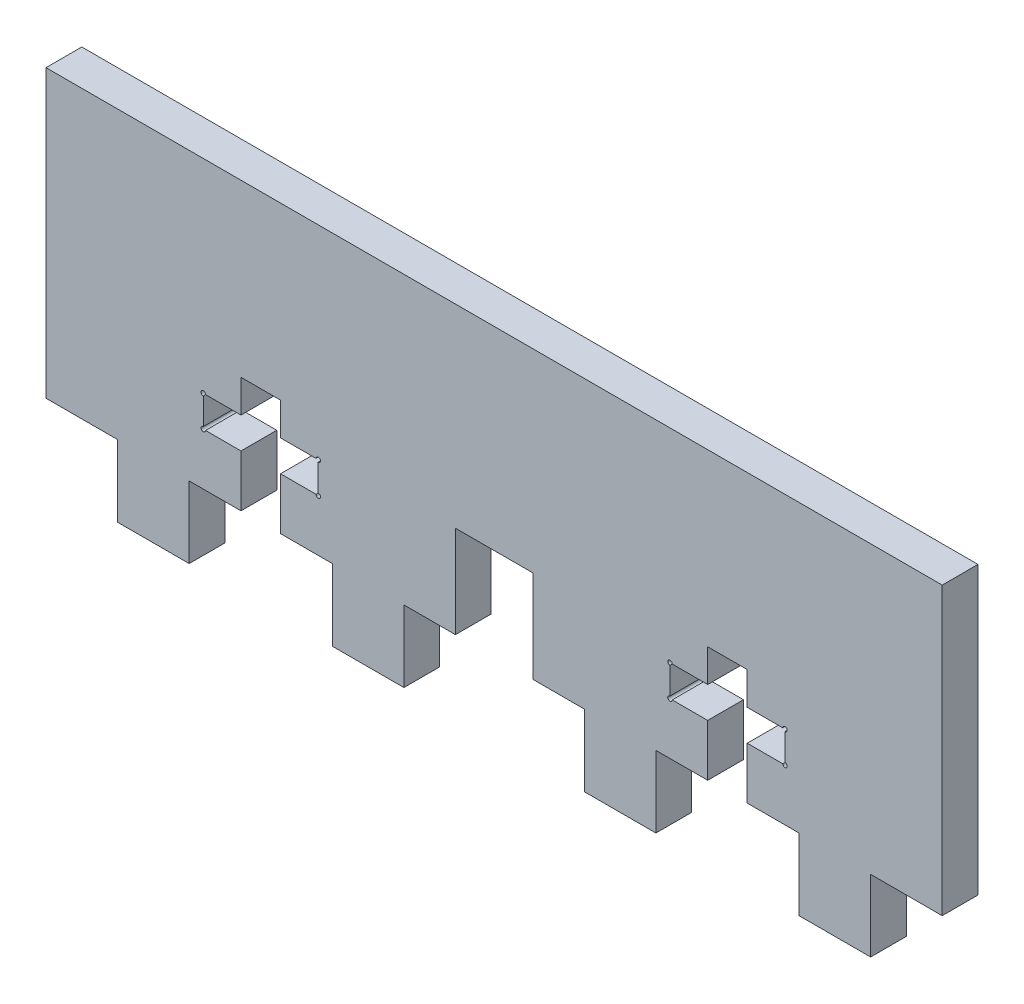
ISO-10303-21;
HEADER;
FILE_DESCRIPTION(('STEP AP214'),'2;1');
FILE_NAME('part.step','',(''),(''),'','','');
FILE_SCHEMA(('AUTOMOTIVE_DESIGN { 1 0 10303 214 1 1 1 1 }'));
ENDSEC;
DATA;
#1=APPLICATION_CONTEXT('core data for automotive mechanical design processes');
#2=APPLICATION_PROTOCOL_DEFINITION('international standard','automotive_design',2000,#1);
#3=PRODUCT_CONTEXT('',#1,'mechanical');
#4=PRODUCT('Part','Part','',(#3));
#5=PRODUCT_RELATED_PRODUCT_CATEGORY('part','',(#4));
#6=PRODUCT_DEFINITION_FORMATION('','',#4);
#7=PRODUCT_DEFINITION_CONTEXT('part definition',#1,'design');
#8=PRODUCT_DEFINITION('design','',#6,#7);
#9=PRODUCT_DEFINITION_SHAPE('','',#8);
#10=(LENGTH_UNIT() NAMED_UNIT(*) SI_UNIT(.MILLI.,.METRE.));
#11=(NAMED_UNIT(*) PLANE_ANGLE_UNIT() SI_UNIT($,.RADIAN.));
#12=(NAMED_UNIT(*) SI_UNIT($,.STERADIAN.) SOLID_ANGLE_UNIT());
#13=UNCERTAINTY_MEASURE_WITH_UNIT(LENGTH_MEASURE(1.E-05),#10,'distance_accuracy_value','');
#14=(GEOMETRIC_REPRESENTATION_CONTEXT(3) GLOBAL_UNCERTAINTY_ASSIGNED_CONTEXT((#13)) GLOBAL_UNIT_ASSIGNED_CONTEXT((#10,
#11,#12)) REPRESENTATION_CONTEXT('',''));
#15=CARTESIAN_POINT('',(0.,0.,0.));
#16=DIRECTION('',(0.,0.,1.));
#17=DIRECTION('',(1.,0.,0.));
#18=AXIS2_PLACEMENT_3D('',#15,#16,#17);
#19=CARTESIAN_POINT('',(-28.651755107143,-2.31194037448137,2.38125));
#20=DIRECTION('',(0.,0.,1.));
#21=DIRECTION('',(1.,0.,0.));
#22=AXIS2_PLACEMENT_3D('',#19,#20,#21);
#23=PLANE('',#22);
#24=DIRECTION('',(0.,-1.,0.));
#25=VECTOR('',#24,1.);
#26=CARTESIAN_POINT('',(4.12403710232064,-2.31194037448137,2.38125));
#27=LINE('',#26,#25);
#28=CARTESIAN_POINT('',(4.12403710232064,1.26818962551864,2.38125));
#29=VERTEX_POINT('',#28);
#30=CARTESIAN_POINT('',(4.12403710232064,0.0883596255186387,2.38125));
#31=VERTEX_POINT('',#30);
#32=EDGE_CURVE('E475',#29,#31,#27,.T.);
#33=ORIENTED_EDGE('',*,*,#32,.T.);
#34=CARTESIAN_POINT('',(4.12403710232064,-0.0107003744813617,2.38125));
#35=DIRECTION('',(0.,0.,1.));
#36=DIRECTION('',(1.,0.,0.));
#37=AXIS2_PLACEMENT_3D('',#34,#35,#36);
#38=CIRCLE('',#37,0.0990600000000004);
#39=CARTESIAN_POINT('',(4.02497710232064,-0.0107003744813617,2.38125));
#40=VERTEX_POINT('',#39);
#41=EDGE_CURVE('E387',#31,#40,#38,.F.);
#42=ORIENTED_EDGE('',*,*,#41,.T.);
#43=DIRECTION('',(-1.,0.,0.));
#44=VECTOR('',#43,1.);
#45=CARTESIAN_POINT('',(-28.651755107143,-0.0107003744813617,2.38125));
#46=LINE('',#45,#44);
#47=CARTESIAN_POINT('',(2.45054489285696,-0.0107003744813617,2.38125));
#48=VERTEX_POINT('',#47);
#49=EDGE_CURVE('E477',#40,#48,#46,.T.);
#50=ORIENTED_EDGE('',*,*,#49,.T.);
#51=DIRECTION('',(0.,-1.,0.));
#52=VECTOR('',#51,1.);
#53=CARTESIAN_POINT('',(2.45054489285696,-2.31194037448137,2.38125));
#54=LINE('',#53,#52);
#55=CARTESIAN_POINT('',(2.45054489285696,-2.31194037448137,2.38125));
#56=VERTEX_POINT('',#55);
#57=EDGE_CURVE('E479',#48,#56,#54,.T.);
#58=ORIENTED_EDGE('',*,*,#57,.T.);
#59=DIRECTION('',(1.,0.,0.));
#60=VECTOR('',#59,1.);
#61=CARTESIAN_POINT('',(-28.651755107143,-2.31194037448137,2.38125));
#62=LINE('',#61,#60);
#63=CARTESIAN_POINT('',(4.74924489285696,-2.31194037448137,2.38125));
#64=VERTEX_POINT('',#63);
#65=EDGE_CURVE('E626',#56,#64,#62,.T.);
#66=ORIENTED_EDGE('',*,*,#65,.T.);
#67=DIRECTION('',(0.,-1.,0.));
#68=VECTOR('',#67,1.);
#69=CARTESIAN_POINT('',(4.74924489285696,-2.31194037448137,2.38125));
#70=LINE('',#69,#68);
#71=CARTESIAN_POINT('',(4.74924489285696,-5.48694037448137,2.38125));
#72=VERTEX_POINT('',#71);
#73=EDGE_CURVE('E483',#64,#72,#70,.T.);
#74=ORIENTED_EDGE('',*,*,#73,.T.);
#75=DIRECTION('',(1.,0.,0.));
#76=VECTOR('',#75,1.);
#77=CARTESIAN_POINT('',(4.74924489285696,-5.48694037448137,2.38125));
#78=LINE('',#77,#76);
#79=CARTESIAN_POINT('',(7.92424489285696,-5.48694037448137,2.38125));
#80=VERTEX_POINT('',#79);
#81=EDGE_CURVE('E485',#72,#80,#78,.T.);
#82=ORIENTED_EDGE('',*,*,#81,.T.);
#83=DIRECTION('',(0.,1.,0.));
#84=VECTOR('',#83,1.);
#85=CARTESIAN_POINT('',(7.92424489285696,-5.48694037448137,2.38125));
#86=LINE('',#85,#84);
#87=CARTESIAN_POINT('',(7.92424489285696,-2.31194037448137,2.38125));
#88=VERTEX_POINT('',#87);
#89=EDGE_CURVE('E488',#80,#88,#86,.T.);
#90=ORIENTED_EDGE('',*,*,#89,.T.);
#91=CARTESIAN_POINT('',(11.099244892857,-2.31194037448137,2.38125));
#92=VERTEX_POINT('',#91);
#93=EDGE_CURVE('E600',#88,#92,#62,.T.);
#94=ORIENTED_EDGE('',*,*,#93,.T.);
#95=DIRECTION('',(0.,1.,0.));
#96=VECTOR('',#95,1.);
#97=CARTESIAN_POINT('',(11.099244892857,10.3880596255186,2.38125));
#98=LINE('',#97,#96);
#99=CARTESIAN_POINT('',(11.099244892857,10.3880596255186,2.38125));
#100=VERTEX_POINT('',#99);
#101=EDGE_CURVE('E604',#92,#100,#98,.T.);
#102=ORIENTED_EDGE('',*,*,#101,.T.);
#103=DIRECTION('',(-1.,0.,0.));
#104=VECTOR('',#103,1.);
#105=CARTESIAN_POINT('',(-28.651755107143,10.3880596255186,2.38125));
#106=LINE('',#105,#104);
#107=CARTESIAN_POINT('',(-28.651755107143,10.3880596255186,2.38125));
#108=VERTEX_POINT('',#107);
#109=EDGE_CURVE('E690',#100,#108,#106,.T.);
#110=ORIENTED_EDGE('',*,*,#109,.T.);
#111=DIRECTION('',(0.,-1.,0.));
#112=VECTOR('',#111,1.);
#113=CARTESIAN_POINT('',(-28.651755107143,10.3880596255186,2.38125));
#114=LINE('',#113,#112);
#115=CARTESIAN_POINT('',(-28.651755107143,-2.31194037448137,2.38125));
#116=VERTEX_POINT('',#115);
#117=EDGE_CURVE('E598',#108,#116,#114,.T.);
#118=ORIENTED_EDGE('',*,*,#117,.T.);
#119=CARTESIAN_POINT('',(-25.476755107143,-2.31194037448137,2.38125));
#120=VERTEX_POINT('',#119);
#121=EDGE_CURVE('E611',#116,#120,#62,.T.);
#122=ORIENTED_EDGE('',*,*,#121,.T.);
#123=DIRECTION('',(0.,-1.,0.));
#124=VECTOR('',#123,1.);
#125=CARTESIAN_POINT('',(-25.476755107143,-2.31194037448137,2.38125));
#126=LINE('',#125,#124);
#127=CARTESIAN_POINT('',(-25.476755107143,-5.48694037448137,2.38125));
#128=VERTEX_POINT('',#127);
#129=EDGE_CURVE('E564',#120,#128,#126,.T.);
#130=ORIENTED_EDGE('',*,*,#129,.T.);
#131=DIRECTION('',(1.,0.,0.));
#132=VECTOR('',#131,1.);
#133=CARTESIAN_POINT('',(-25.476755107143,-5.48694037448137,2.38125));
#134=LINE('',#133,#132);
#135=CARTESIAN_POINT('',(-22.301755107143,-5.48694037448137,2.38125));
#136=VERTEX_POINT('',#135);
#137=EDGE_CURVE('E561',#128,#136,#134,.T.);
#138=ORIENTED_EDGE('',*,*,#137,.T.);
#139=DIRECTION('',(0.,1.,0.));
#140=VECTOR('',#139,1.);
#141=CARTESIAN_POINT('',(-22.301755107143,-5.48694037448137,2.38125));
#142=LINE('',#141,#140);
#143=CARTESIAN_POINT('',(-22.301755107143,-2.31194037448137,2.38125));
#144=VERTEX_POINT('',#143);
#145=EDGE_CURVE('E563',#136,#144,#142,.T.);
#146=ORIENTED_EDGE('',*,*,#145,.T.);
#147=CARTESIAN_POINT('',(-20.003055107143,-2.31194037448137,2.38125));
#148=VERTEX_POINT('',#147);
#149=EDGE_CURVE('E577',#144,#148,#62,.T.);
#150=ORIENTED_EDGE('',*,*,#149,.T.);
#151=DIRECTION('',(0.,1.,0.));
#152=VECTOR('',#151,1.);
#153=CARTESIAN_POINT('',(-20.003055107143,-2.31194037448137,2.38125));
#154=LINE('',#153,#152);
#155=CARTESIAN_POINT('',(-20.003055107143,-0.0107003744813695,2.38125));
#156=VERTEX_POINT('',#155);
#157=EDGE_CURVE('E703',#148,#156,#154,.T.);
#158=ORIENTED_EDGE('',*,*,#157,.T.);
#159=DIRECTION('',(-1.,0.,0.));
#160=VECTOR('',#159,1.);
#161=CARTESIAN_POINT('',(-28.651755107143,-0.0107003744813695,2.38125));
#162=LINE('',#161,#160);
#163=CARTESIAN_POINT('',(-21.5774873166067,-0.0107003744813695,2.38125));
#164=VERTEX_POINT('',#163);
#165=EDGE_CURVE('E744',#156,#164,#162,.T.);
#166=ORIENTED_EDGE('',*,*,#165,.T.);
#167=CARTESIAN_POINT('',(-21.6765473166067,-0.0107003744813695,2.38125));
#168=DIRECTION('',(0.,0.,1.));
#169=DIRECTION('',(1.,0.,0.));
#170=AXIS2_PLACEMENT_3D('',#167,#168,#169);
#171=CIRCLE('',#170,0.0990600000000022);
#172=CARTESIAN_POINT('',(-21.6765473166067,0.0883596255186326,2.38125));
#173=VERTEX_POINT('',#172);
#174=EDGE_CURVE('E1287',#164,#173,#171,.F.);
#175=ORIENTED_EDGE('',*,*,#174,.T.);
#176=DIRECTION('',(0.,1.,0.));
#177=VECTOR('',#176,1.);
#178=CARTESIAN_POINT('',(-21.6765473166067,-2.31194037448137,2.38125));
#179=LINE('',#178,#177);
#180=CARTESIAN_POINT('',(-21.6765473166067,1.26818962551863,2.38125));
#181=VERTEX_POINT('',#180);
#182=EDGE_CURVE('E746',#173,#181,#179,.T.);
#183=ORIENTED_EDGE('',*,*,#182,.T.);
#184=CARTESIAN_POINT('',(-21.6765473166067,1.36724962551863,2.38125));
#185=DIRECTION('',(0.,0.,1.));
#186=DIRECTION('',(1.,0.,0.));
#187=AXIS2_PLACEMENT_3D('',#184,#185,#186);
#188=CIRCLE('',#187,0.0990600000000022);
#189=CARTESIAN_POINT('',(-21.5774873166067,1.36724962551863,2.38125));
#190=VERTEX_POINT('',#189);
#191=EDGE_CURVE('E1296',#181,#190,#188,.F.);
#192=ORIENTED_EDGE('',*,*,#191,.T.);
#193=DIRECTION('',(1.,0.,0.));
#194=VECTOR('',#193,1.);
#195=CARTESIAN_POINT('',(-28.651755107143,1.36724962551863,2.38125));
#196=LINE('',#195,#194);
#197=CARTESIAN_POINT('',(-20.003055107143,1.36724962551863,2.38125));
#198=VERTEX_POINT('',#197);
#199=EDGE_CURVE('E748',#190,#198,#196,.T.);
#200=ORIENTED_EDGE('',*,*,#199,.T.);
#201=DIRECTION('',(0.,1.,0.));
#202=VECTOR('',#201,1.);
#203=CARTESIAN_POINT('',(-20.003055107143,-2.31194037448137,2.38125));
#204=LINE('',#203,#202);
#205=CARTESIAN_POINT('',(-20.003055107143,2.81758962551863,2.38125));
#206=VERTEX_POINT('',#205);
#207=EDGE_CURVE('E750',#198,#206,#204,.T.);
#208=ORIENTED_EDGE('',*,*,#207,.T.);
#209=DIRECTION('',(1.,0.,0.));
#210=VECTOR('',#209,1.);
#211=CARTESIAN_POINT('',(-28.651755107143,2.81758962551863,2.38125));
#212=LINE('',#211,#210);
#213=CARTESIAN_POINT('',(-18.250455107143,2.81758962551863,2.38125));
#214=VERTEX_POINT('',#213);
#215=EDGE_CURVE('E753',#206,#214,#212,.T.);
#216=ORIENTED_EDGE('',*,*,#215,.T.);
#217=DIRECTION('',(0.,-1.,0.));
#218=VECTOR('',#217,1.);
#219=CARTESIAN_POINT('',(-18.250455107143,-2.31194037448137,2.38125));
#220=LINE('',#219,#218);
#221=CARTESIAN_POINT('',(-18.250455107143,1.36724962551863,2.38125));
#222=VERTEX_POINT('',#221);
#223=EDGE_CURVE('E756',#214,#222,#220,.T.);
#224=ORIENTED_EDGE('',*,*,#223,.T.);
#225=DIRECTION('',(1.,0.,0.));
#226=VECTOR('',#225,1.);
#227=CARTESIAN_POINT('',(-28.651755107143,1.36724962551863,2.38125));
#228=LINE('',#227,#226);
#229=CARTESIAN_POINT('',(-16.6760228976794,1.36724962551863,2.38125));
#230=VERTEX_POINT('',#229);
#231=EDGE_CURVE('E759',#222,#230,#228,.T.);
#232=ORIENTED_EDGE('',*,*,#231,.T.);
#233=CARTESIAN_POINT('',(-16.5769628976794,1.36724962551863,2.38125));
#234=DIRECTION('',(0.,0.,1.));
#235=DIRECTION('',(1.,0.,0.));
#236=AXIS2_PLACEMENT_3D('',#233,#234,#235);
#237=CIRCLE('',#236,0.0990600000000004);
#238=CARTESIAN_POINT('',(-16.5769628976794,1.26818962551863,2.38125));
#239=VERTEX_POINT('',#238);
#240=EDGE_CURVE('E1279',#230,#239,#237,.F.);
#241=ORIENTED_EDGE('',*,*,#240,.T.);
#242=DIRECTION('',(0.,-1.,0.));
#243=VECTOR('',#242,1.);
#244=CARTESIAN_POINT('',(-16.5769628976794,-2.31194037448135,2.38125));
#245=LINE('',#244,#243);
#246=CARTESIAN_POINT('',(-16.5769628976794,0.0883596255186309,2.38125));
#247=VERTEX_POINT('',#246);
#248=EDGE_CURVE('E762',#239,#247,#245,.T.);
#249=ORIENTED_EDGE('',*,*,#248,.T.);
#250=CARTESIAN_POINT('',(-16.5769628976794,-0.0107003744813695,2.38125));
#251=DIRECTION('',(0.,0.,1.));
#252=DIRECTION('',(1.,0.,0.));
#253=AXIS2_PLACEMENT_3D('',#250,#251,#252);
#254=CIRCLE('',#253,0.0990600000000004);
#255=CARTESIAN_POINT('',(-16.6760228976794,-0.0107003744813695,2.38125));
#256=VERTEX_POINT('',#255);
#257=EDGE_CURVE('E1270',#247,#256,#254,.F.);
#258=ORIENTED_EDGE('',*,*,#257,.T.);
#259=DIRECTION('',(-1.,0.,0.));
#260=VECTOR('',#259,1.);
#261=CARTESIAN_POINT('',(-28.651755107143,-0.0107003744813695,2.38125));
#262=LINE('',#261,#260);
#263=CARTESIAN_POINT('',(-18.250455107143,-0.0107003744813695,2.38125));
#264=VERTEX_POINT('',#263);
#265=EDGE_CURVE('E765',#256,#264,#262,.T.);
#266=ORIENTED_EDGE('',*,*,#265,.T.);
#267=DIRECTION('',(0.,-1.,0.));
#268=VECTOR('',#267,1.);
#269=CARTESIAN_POINT('',(-18.250455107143,-2.31194037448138,2.38125));
#270=LINE('',#269,#268);
#271=CARTESIAN_POINT('',(-18.250455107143,-2.31194037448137,2.38125));
#272=VERTEX_POINT('',#271);
#273=EDGE_CURVE('E741',#264,#272,#270,.T.);
#274=ORIENTED_EDGE('',*,*,#273,.T.);
#275=CARTESIAN_POINT('',(-15.951755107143,-2.31194037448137,2.38125));
#276=VERTEX_POINT('',#275);
#277=EDGE_CURVE('E628',#272,#276,#62,.T.);
#278=ORIENTED_EDGE('',*,*,#277,.T.);
#279=DIRECTION('',(0.,-1.,0.));
#280=VECTOR('',#279,1.);
#281=CARTESIAN_POINT('',(-15.951755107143,-2.31194037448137,2.38125));
#282=LINE('',#281,#280);
#283=CARTESIAN_POINT('',(-15.951755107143,-5.48694037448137,2.38125));
#284=VERTEX_POINT('',#283);
#285=EDGE_CURVE('E535',#276,#284,#282,.T.);
#286=ORIENTED_EDGE('',*,*,#285,.T.);
#287=DIRECTION('',(1.,0.,0.));
#288=VECTOR('',#287,1.);
#289=CARTESIAN_POINT('',(-15.951755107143,-5.48694037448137,2.38125));
#290=LINE('',#289,#288);
#291=CARTESIAN_POINT('',(-12.776755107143,-5.48694037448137,2.38125));
#292=VERTEX_POINT('',#291);
#293=EDGE_CURVE('E537',#284,#292,#290,.T.);
#294=ORIENTED_EDGE('',*,*,#293,.T.);
#295=DIRECTION('',(0.,1.,0.));
#296=VECTOR('',#295,1.);
#297=CARTESIAN_POINT('',(-12.776755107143,-5.48694037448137,2.38125));
#298=LINE('',#297,#296);
#299=CARTESIAN_POINT('',(-12.776755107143,-2.31194037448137,2.38125));
#300=VERTEX_POINT('',#299);
#301=EDGE_CURVE('E540',#292,#300,#298,.T.);
#302=ORIENTED_EDGE('',*,*,#301,.T.);
#303=CARTESIAN_POINT('',(-10.490755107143,-2.31194037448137,2.38125));
#304=VERTEX_POINT('',#303);
#305=EDGE_CURVE('E615',#300,#304,#62,.T.);
#306=ORIENTED_EDGE('',*,*,#305,.T.);
#307=DIRECTION('',(0.,1.,0.));
#308=VECTOR('',#307,1.);
#309=CARTESIAN_POINT('',(-10.490755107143,-2.31194037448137,2.38125));
#310=LINE('',#309,#308);
#311=CARTESIAN_POINT('',(-10.490755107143,1.77745962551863,2.38125));
#312=VERTEX_POINT('',#311);
#313=EDGE_CURVE('E1318',#304,#312,#310,.T.);
#314=ORIENTED_EDGE('',*,*,#313,.T.);
#315=DIRECTION('',(1.,0.,0.));
#316=VECTOR('',#315,1.);
#317=CARTESIAN_POINT('',(-28.651755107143,1.77745962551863,2.38125));
#318=LINE('',#317,#316);
#319=CARTESIAN_POINT('',(-7.06175510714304,1.77745962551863,2.38125));
#320=VERTEX_POINT('',#319);
#321=EDGE_CURVE('E1321',#312,#320,#318,.T.);
#322=ORIENTED_EDGE('',*,*,#321,.T.);
#323=DIRECTION('',(0.,-1.,0.));
#324=VECTOR('',#323,1.);
#325=CARTESIAN_POINT('',(-7.06175510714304,-2.31194037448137,2.38125));
#326=LINE('',#325,#324);
#327=CARTESIAN_POINT('',(-7.06175510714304,-2.31194037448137,2.38125));
#328=VERTEX_POINT('',#327);
#329=EDGE_CURVE('E1315',#320,#328,#326,.T.);
#330=ORIENTED_EDGE('',*,*,#329,.T.);
#331=CARTESIAN_POINT('',(-4.77575510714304,-2.31194037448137,2.38125));
#332=VERTEX_POINT('',#331);
#333=EDGE_CURVE('E774',#328,#332,#62,.T.);
#334=ORIENTED_EDGE('',*,*,#333,.T.);
#335=DIRECTION('',(0.,-1.,0.));
#336=VECTOR('',#335,1.);
#337=CARTESIAN_POINT('',(-4.77575510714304,-2.31194037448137,2.38125));
#338=LINE('',#337,#336);
#339=CARTESIAN_POINT('',(-4.77575510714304,-5.48694037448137,2.38125));
#340=VERTEX_POINT('',#339);
#341=EDGE_CURVE('E509',#332,#340,#338,.T.);
#342=ORIENTED_EDGE('',*,*,#341,.T.);
#343=DIRECTION('',(1.,0.,0.));
#344=VECTOR('',#343,1.);
#345=CARTESIAN_POINT('',(-4.77575510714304,-5.48694037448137,2.38125));
#346=LINE('',#345,#344);
#347=CARTESIAN_POINT('',(-1.60075510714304,-5.48694037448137,2.38125));
#348=VERTEX_POINT('',#347);
#349=EDGE_CURVE('E511',#340,#348,#346,.T.);
#350=ORIENTED_EDGE('',*,*,#349,.T.);
#351=DIRECTION('',(0.,1.,0.));
#352=VECTOR('',#351,1.);
#353=CARTESIAN_POINT('',(-1.60075510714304,-5.48694037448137,2.38125));
#354=LINE('',#353,#352);
#355=CARTESIAN_POINT('',(-1.60075510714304,-2.31194037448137,2.38125));
#356=VERTEX_POINT('',#355);
#357=EDGE_CURVE('E514',#348,#356,#354,.T.);
#358=ORIENTED_EDGE('',*,*,#357,.T.);
#359=CARTESIAN_POINT('',(0.69794489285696,-2.31194037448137,2.38125));
#360=VERTEX_POINT('',#359);
#361=EDGE_CURVE('E620',#356,#360,#62,.T.);
#362=ORIENTED_EDGE('',*,*,#361,.T.);
#363=DIRECTION('',(0.,1.,0.));
#364=VECTOR('',#363,1.);
#365=CARTESIAN_POINT('',(0.69794489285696,-2.31194037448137,2.38125));
#366=LINE('',#365,#364);
#367=CARTESIAN_POINT('',(0.69794489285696,-0.0107003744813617,2.38125));
#368=VERTEX_POINT('',#367);
#369=EDGE_CURVE('E453',#360,#368,#366,.T.);
#370=ORIENTED_EDGE('',*,*,#369,.T.);
#371=DIRECTION('',(-1.,0.,0.));
#372=VECTOR('',#371,1.);
#373=CARTESIAN_POINT('',(-28.651755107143,-0.0107003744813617,2.38125));
#374=LINE('',#373,#372);
#375=CARTESIAN_POINT('',(-0.876487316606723,-0.0107003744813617,2.38125));
#376=VERTEX_POINT('',#375);
#377=EDGE_CURVE('E456',#368,#376,#374,.T.);
#378=ORIENTED_EDGE('',*,*,#377,.T.);
#379=CARTESIAN_POINT('',(-0.975547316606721,-0.0107003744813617,2.38125));
#380=DIRECTION('',(0.,0.,1.));
#381=DIRECTION('',(1.,0.,0.));
#382=AXIS2_PLACEMENT_3D('',#379,#380,#381);
#383=CIRCLE('',#382,0.0990599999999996);
#384=CARTESIAN_POINT('',(-0.975547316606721,0.0883596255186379,2.38125));
#385=VERTEX_POINT('',#384);
#386=EDGE_CURVE('E1252',#376,#385,#383,.F.);
#387=ORIENTED_EDGE('',*,*,#386,.T.);
#388=DIRECTION('',(0.,1.,0.));
#389=VECTOR('',#388,1.);
#390=CARTESIAN_POINT('',(-0.975547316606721,-2.31194037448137,2.38125));
#391=LINE('',#390,#389);
#392=CARTESIAN_POINT('',(-0.975547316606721,1.26818962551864,2.38125));
#393=VERTEX_POINT('',#392);
#394=EDGE_CURVE('E459',#385,#393,#391,.T.);
#395=ORIENTED_EDGE('',*,*,#394,.T.);
#396=CARTESIAN_POINT('',(-0.975547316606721,1.36724962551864,2.38125));
#397=DIRECTION('',(0.,0.,1.));
#398=DIRECTION('',(1.,0.,0.));
#399=AXIS2_PLACEMENT_3D('',#396,#397,#398);
#400=CIRCLE('',#399,0.0990599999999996);
#401=CARTESIAN_POINT('',(-0.876487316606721,1.36724962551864,2.38125));
#402=VERTEX_POINT('',#401);
#403=EDGE_CURVE('E1261',#393,#402,#400,.F.);
#404=ORIENTED_EDGE('',*,*,#403,.T.);
#405=DIRECTION('',(1.,0.,0.));
#406=VECTOR('',#405,1.);
#407=CARTESIAN_POINT('',(-28.651755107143,1.36724962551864,2.38125));
#408=LINE('',#407,#406);
#409=CARTESIAN_POINT('',(0.69794489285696,1.36724962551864,2.38125));
#410=VERTEX_POINT('',#409);
#411=EDGE_CURVE('E461',#402,#410,#408,.T.);
#412=ORIENTED_EDGE('',*,*,#411,.T.);
#413=DIRECTION('',(0.,1.,0.));
#414=VECTOR('',#413,1.);
#415=CARTESIAN_POINT('',(0.69794489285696,-2.31194037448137,2.38125));
#416=LINE('',#415,#414);
#417=CARTESIAN_POINT('',(0.69794489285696,2.81758962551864,2.38125));
#418=VERTEX_POINT('',#417);
#419=EDGE_CURVE('E463',#410,#418,#416,.T.);
#420=ORIENTED_EDGE('',*,*,#419,.T.);
#421=DIRECTION('',(1.,0.,0.));
#422=VECTOR('',#421,1.);
#423=CARTESIAN_POINT('',(-28.651755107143,2.81758962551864,2.38125));
#424=LINE('',#423,#422);
#425=CARTESIAN_POINT('',(2.45054489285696,2.81758962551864,2.38125));
#426=VERTEX_POINT('',#425);
#427=EDGE_CURVE('E466',#418,#426,#424,.T.);
#428=ORIENTED_EDGE('',*,*,#427,.T.);
#429=DIRECTION('',(0.,-1.,0.));
#430=VECTOR('',#429,1.);
#431=CARTESIAN_POINT('',(2.45054489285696,-2.31194037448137,2.38125));
#432=LINE('',#431,#430);
#433=CARTESIAN_POINT('',(2.45054489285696,1.36724962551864,2.38125));
#434=VERTEX_POINT('',#433);
#435=EDGE_CURVE('E469',#426,#434,#432,.T.);
#436=ORIENTED_EDGE('',*,*,#435,.T.);
#437=DIRECTION('',(1.,0.,0.));
#438=VECTOR('',#437,1.);
#439=CARTESIAN_POINT('',(-28.651755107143,1.36724962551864,2.38125));
#440=LINE('',#439,#438);
#441=CARTESIAN_POINT('',(4.02497710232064,1.36724962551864,2.38125));
#442=VERTEX_POINT('',#441);
#443=EDGE_CURVE('E472',#434,#442,#440,.T.);
#444=ORIENTED_EDGE('',*,*,#443,.T.);
#445=CARTESIAN_POINT('',(4.12403710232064,1.36724962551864,2.38125));
#446=DIRECTION('',(0.,0.,1.));
#447=DIRECTION('',(1.,0.,0.));
#448=AXIS2_PLACEMENT_3D('',#445,#446,#447);
#449=CIRCLE('',#448,0.0990600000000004);
#450=EDGE_CURVE('E56',#442,#29,#449,.F.);
#451=ORIENTED_EDGE('',*,*,#450,.T.);
#452=EDGE_LOOP('',(#33,#42,#50,#58,#66,#74,#82,#90,#94,#102,#110,#118,#122,#130,#138,#146,#150,
#158,#166,#175,#183,#192,#200,#208,#216,#224,#232,#241,#249,#258,#266,#274,#278,#286,#294,#302,
#306,#314,#322,#330,#334,#342,#350,#358,#362,#370,#378,#387,#395,#404,#412,#420,#428,#436,#444,#451));
#453=FACE_BOUND('',#452,.T.);
#454=ADVANCED_FACE('F34',(#453),#23,.T.);
#455=CARTESIAN_POINT('',(-28.651755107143,-2.31194037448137,0.79375));
#456=DIRECTION('',(0.,0.,1.));
#457=DIRECTION('',(1.,0.,0.));
#458=AXIS2_PLACEMENT_3D('',#455,#456,#457);
#459=PLANE('',#458);
#460=CARTESIAN_POINT('',(4.12403710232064,-0.0107003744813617,0.79375));
#461=DIRECTION('',(0.,0.,1.));
#462=DIRECTION('',(1.,0.,0.));
#463=AXIS2_PLACEMENT_3D('',#460,#461,#462);
#464=CIRCLE('',#463,0.0990600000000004);
#465=CARTESIAN_POINT('',(4.02497710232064,-0.0107003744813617,0.79375));
#466=VERTEX_POINT('',#465);
#467=CARTESIAN_POINT('',(4.12403710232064,0.0883596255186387,0.79375));
#468=VERTEX_POINT('',#467);
#469=EDGE_CURVE('E49',#466,#468,#464,.T.);
#470=ORIENTED_EDGE('',*,*,#469,.T.);
#471=DIRECTION('',(0.,1.,0.));
#472=VECTOR('',#471,1.);
#473=CARTESIAN_POINT('',(4.12403710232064,1.36724962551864,0.79375));
#474=LINE('',#473,#472);
#475=CARTESIAN_POINT('',(4.12403710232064,1.26818962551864,0.79375));
#476=VERTEX_POINT('',#475);
#477=EDGE_CURVE('E398',#468,#476,#474,.T.);
#478=ORIENTED_EDGE('',*,*,#477,.T.);
#479=CARTESIAN_POINT('',(4.12403710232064,1.36724962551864,0.79375));
#480=DIRECTION('',(0.,0.,1.));
#481=DIRECTION('',(1.,0.,0.));
#482=AXIS2_PLACEMENT_3D('',#479,#480,#481);
#483=CIRCLE('',#482,0.0990600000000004);
#484=CARTESIAN_POINT('',(4.02497710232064,1.36724962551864,0.79375));
#485=VERTEX_POINT('',#484);
#486=EDGE_CURVE('E392',#476,#485,#483,.T.);
#487=ORIENTED_EDGE('',*,*,#486,.T.);
#488=DIRECTION('',(-1.,0.,0.));
#489=VECTOR('',#488,1.);
#490=CARTESIAN_POINT('',(2.45054489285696,1.36724962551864,0.79375));
#491=LINE('',#490,#489);
#492=CARTESIAN_POINT('',(2.45054489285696,1.36724962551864,0.79375));
#493=VERTEX_POINT('',#492);
#494=EDGE_CURVE('E407',#485,#493,#491,.T.);
#495=ORIENTED_EDGE('',*,*,#494,.T.);
#496=DIRECTION('',(0.,1.,0.));
#497=VECTOR('',#496,1.);
#498=CARTESIAN_POINT('',(2.45054489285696,2.81758962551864,0.79375));
#499=LINE('',#498,#497);
#500=CARTESIAN_POINT('',(2.45054489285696,2.81758962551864,0.79375));
#501=VERTEX_POINT('',#500);
#502=EDGE_CURVE('E409',#493,#501,#499,.T.);
#503=ORIENTED_EDGE('',*,*,#502,.T.);
#504=DIRECTION('',(-1.,0.,0.));
#505=VECTOR('',#504,1.);
#506=CARTESIAN_POINT('',(0.69794489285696,2.81758962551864,0.79375));
#507=LINE('',#506,#505);
#508=CARTESIAN_POINT('',(0.69794489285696,2.81758962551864,0.79375));
#509=VERTEX_POINT('',#508);
#510=EDGE_CURVE('E417',#501,#509,#507,.T.);
#511=ORIENTED_EDGE('',*,*,#510,.T.);
#512=DIRECTION('',(0.,-1.,0.));
#513=VECTOR('',#512,1.);
#514=CARTESIAN_POINT('',(0.69794489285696,1.36724962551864,0.79375));
#515=LINE('',#514,#513);
#516=CARTESIAN_POINT('',(0.69794489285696,1.36724962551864,0.79375));
#517=VERTEX_POINT('',#516);
#518=EDGE_CURVE('E420',#509,#517,#515,.T.);
#519=ORIENTED_EDGE('',*,*,#518,.T.);
#520=DIRECTION('',(-1.,0.,0.));
#521=VECTOR('',#520,1.);
#522=CARTESIAN_POINT('',(-0.975547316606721,1.36724962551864,0.79375));
#523=LINE('',#522,#521);
#524=CARTESIAN_POINT('',(-0.876487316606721,1.36724962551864,0.79375));
#525=VERTEX_POINT('',#524);
#526=EDGE_CURVE('E423',#517,#525,#523,.T.);
#527=ORIENTED_EDGE('',*,*,#526,.T.);
#528=CARTESIAN_POINT('',(-0.975547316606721,1.36724962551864,0.79375));
#529=DIRECTION('',(0.,0.,1.));
#530=DIRECTION('',(1.,0.,0.));
#531=AXIS2_PLACEMENT_3D('',#528,#529,#530);
#532=CIRCLE('',#531,0.0990599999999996);
#533=CARTESIAN_POINT('',(-0.975547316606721,1.26818962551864,0.79375));
#534=VERTEX_POINT('',#533);
#535=EDGE_CURVE('E1258',#525,#534,#532,.T.);
#536=ORIENTED_EDGE('',*,*,#535,.T.);
#537=DIRECTION('',(0.,-1.,0.));
#538=VECTOR('',#537,1.);
#539=CARTESIAN_POINT('',(-0.975547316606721,-0.0107003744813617,0.79375));
#540=LINE('',#539,#538);
#541=CARTESIAN_POINT('',(-0.975547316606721,0.0883596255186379,0.79375));
#542=VERTEX_POINT('',#541);
#543=EDGE_CURVE('E426',#534,#542,#540,.T.);
#544=ORIENTED_EDGE('',*,*,#543,.T.);
#545=CARTESIAN_POINT('',(-0.975547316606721,-0.0107003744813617,0.79375));
#546=DIRECTION('',(0.,0.,1.));
#547=DIRECTION('',(1.,0.,0.));
#548=AXIS2_PLACEMENT_3D('',#545,#546,#547);
#549=CIRCLE('',#548,0.0990599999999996);
#550=CARTESIAN_POINT('',(-0.876487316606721,-0.0107003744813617,0.79375));
#551=VERTEX_POINT('',#550);
#552=EDGE_CURVE('E1249',#542,#551,#549,.T.);
#553=ORIENTED_EDGE('',*,*,#552,.T.);
#554=DIRECTION('',(1.,0.,0.));
#555=VECTOR('',#554,1.);
#556=CARTESIAN_POINT('',(0.69794489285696,-0.0107003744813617,0.79375));
#557=LINE('',#556,#555);
#558=CARTESIAN_POINT('',(0.69794489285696,-0.0107003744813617,0.79375));
#559=VERTEX_POINT('',#558);
#560=EDGE_CURVE('E429',#551,#559,#557,.T.);
#561=ORIENTED_EDGE('',*,*,#560,.T.);
#562=DIRECTION('',(0.,-1.,0.));
#563=VECTOR('',#562,1.);
#564=CARTESIAN_POINT('',(0.69794489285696,-2.31194037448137,0.79375));
#565=LINE('',#564,#563);
#566=CARTESIAN_POINT('',(0.69794489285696,-2.31194037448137,0.79375));
#567=VERTEX_POINT('',#566);
#568=EDGE_CURVE('E431',#559,#567,#565,.T.);
#569=ORIENTED_EDGE('',*,*,#568,.T.);
#570=DIRECTION('',(1.,0.,0.));
#571=VECTOR('',#570,1.);
#572=CARTESIAN_POINT('',(-28.651755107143,-2.31194037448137,0.79375));
#573=LINE('',#572,#571);
#574=CARTESIAN_POINT('',(-1.60075510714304,-2.31194037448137,0.79375));
#575=VERTEX_POINT('',#574);
#576=EDGE_CURVE('E652',#575,#567,#573,.T.);
#577=ORIENTED_EDGE('',*,*,#576,.F.);
#578=DIRECTION('',(0.,1.,0.));
#579=VECTOR('',#578,1.);
#580=CARTESIAN_POINT('',(-1.60075510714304,-5.48694037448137,0.79375));
#581=LINE('',#580,#579);
#582=CARTESIAN_POINT('',(-1.60075510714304,-5.48694037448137,0.79375));
#583=VERTEX_POINT('',#582);
#584=EDGE_CURVE('E512',#583,#575,#581,.T.);
#585=ORIENTED_EDGE('',*,*,#584,.F.);
#586=DIRECTION('',(1.,0.,0.));
#587=VECTOR('',#586,1.);
#588=CARTESIAN_POINT('',(-4.77575510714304,-5.48694037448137,0.79375));
#589=LINE('',#588,#587);
#590=CARTESIAN_POINT('',(-4.77575510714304,-5.48694037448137,0.79375));
#591=VERTEX_POINT('',#590);
#592=EDGE_CURVE('E519',#591,#583,#589,.T.);
#593=ORIENTED_EDGE('',*,*,#592,.F.);
#594=DIRECTION('',(0.,-1.,0.));
#595=VECTOR('',#594,1.);
#596=CARTESIAN_POINT('',(-4.77575510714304,-2.31194037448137,0.79375));
#597=LINE('',#596,#595);
#598=CARTESIAN_POINT('',(-4.77575510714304,-2.31194037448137,0.79375));
#599=VERTEX_POINT('',#598);
#600=EDGE_CURVE('E508',#599,#591,#597,.T.);
#601=ORIENTED_EDGE('',*,*,#600,.F.);
#602=CARTESIAN_POINT('',(-7.06175510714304,-2.31194037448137,0.79375));
#603=VERTEX_POINT('',#602);
#604=EDGE_CURVE('E661',#603,#599,#573,.T.);
#605=ORIENTED_EDGE('',*,*,#604,.F.);
#606=DIRECTION('',(0.,1.,0.));
#607=VECTOR('',#606,1.);
#608=CARTESIAN_POINT('',(-7.06175510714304,-2.31194037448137,0.79375));
#609=LINE('',#608,#607);
#610=CARTESIAN_POINT('',(-7.06175510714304,1.77745962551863,0.79375));
#611=VERTEX_POINT('',#610);
#612=EDGE_CURVE('E1305',#603,#611,#609,.T.);
#613=ORIENTED_EDGE('',*,*,#612,.T.);
#614=DIRECTION('',(-1.,0.,0.));
#615=VECTOR('',#614,1.);
#616=CARTESIAN_POINT('',(-10.490755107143,1.77745962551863,0.79375));
#617=LINE('',#616,#615);
#618=CARTESIAN_POINT('',(-10.490755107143,1.77745962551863,0.79375));
#619=VERTEX_POINT('',#618);
#620=EDGE_CURVE('E1308',#611,#619,#617,.T.);
#621=ORIENTED_EDGE('',*,*,#620,.T.);
#622=DIRECTION('',(0.,-1.,0.));
#623=VECTOR('',#622,1.);
#624=CARTESIAN_POINT('',(-10.490755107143,-2.31194037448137,0.79375));
#625=LINE('',#624,#623);
#626=CARTESIAN_POINT('',(-10.490755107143,-2.31194037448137,0.79375));
#627=VERTEX_POINT('',#626);
#628=EDGE_CURVE('E1302',#619,#627,#625,.T.);
#629=ORIENTED_EDGE('',*,*,#628,.T.);
#630=CARTESIAN_POINT('',(-12.776755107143,-2.31194037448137,0.79375));
#631=VERTEX_POINT('',#630);
#632=EDGE_CURVE('E634',#631,#627,#573,.T.);
#633=ORIENTED_EDGE('',*,*,#632,.F.);
#634=DIRECTION('',(0.,1.,0.));
#635=VECTOR('',#634,1.);
#636=CARTESIAN_POINT('',(-12.776755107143,-5.48694037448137,0.79375));
#637=LINE('',#636,#635);
#638=CARTESIAN_POINT('',(-12.776755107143,-5.48694037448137,0.79375));
#639=VERTEX_POINT('',#638);
#640=EDGE_CURVE('E538',#639,#631,#637,.T.);
#641=ORIENTED_EDGE('',*,*,#640,.F.);
#642=DIRECTION('',(1.,0.,0.));
#643=VECTOR('',#642,1.);
#644=CARTESIAN_POINT('',(-15.951755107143,-5.48694037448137,0.79375));
#645=LINE('',#644,#643);
#646=CARTESIAN_POINT('',(-15.951755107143,-5.48694037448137,0.79375));
#647=VERTEX_POINT('',#646);
#648=EDGE_CURVE('E545',#647,#639,#645,.T.);
#649=ORIENTED_EDGE('',*,*,#648,.F.);
#650=DIRECTION('',(0.,-1.,0.));
#651=VECTOR('',#650,1.);
#652=CARTESIAN_POINT('',(-15.951755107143,-2.31194037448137,0.79375));
#653=LINE('',#652,#651);
#654=CARTESIAN_POINT('',(-15.951755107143,-2.31194037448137,0.79375));
#655=VERTEX_POINT('',#654);
#656=EDGE_CURVE('E534',#655,#647,#653,.T.);
#657=ORIENTED_EDGE('',*,*,#656,.F.);
#658=CARTESIAN_POINT('',(-18.250455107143,-2.31194037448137,0.79375));
#659=VERTEX_POINT('',#658);
#660=EDGE_CURVE('E630',#659,#655,#573,.T.);
#661=ORIENTED_EDGE('',*,*,#660,.F.);
#662=DIRECTION('',(0.,1.,0.));
#663=VECTOR('',#662,1.);
#664=CARTESIAN_POINT('',(-18.250455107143,-0.0107003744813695,0.79375));
#665=LINE('',#664,#663);
#666=CARTESIAN_POINT('',(-18.250455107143,-0.0107003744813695,0.79375));
#667=VERTEX_POINT('',#666);
#668=EDGE_CURVE('E1324',#659,#667,#665,.T.);
#669=ORIENTED_EDGE('',*,*,#668,.T.);
#670=DIRECTION('',(1.,0.,0.));
#671=VECTOR('',#670,1.);
#672=CARTESIAN_POINT('',(-16.5769628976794,-0.0107003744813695,0.79375));
#673=LINE('',#672,#671);
#674=CARTESIAN_POINT('',(-16.6760228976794,-0.0107003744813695,0.79375));
#675=VERTEX_POINT('',#674);
#676=EDGE_CURVE('E1327',#667,#675,#673,.T.);
#677=ORIENTED_EDGE('',*,*,#676,.T.);
#678=CARTESIAN_POINT('',(-16.5769628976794,-0.0107003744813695,0.79375));
#679=DIRECTION('',(0.,0.,1.));
#680=DIRECTION('',(1.,0.,0.));
#681=AXIS2_PLACEMENT_3D('',#678,#679,#680);
#682=CIRCLE('',#681,0.0990600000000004);
#683=CARTESIAN_POINT('',(-16.5769628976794,0.0883596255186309,0.79375));
#684=VERTEX_POINT('',#683);
#685=EDGE_CURVE('E1267',#675,#684,#682,.T.);
#686=ORIENTED_EDGE('',*,*,#685,.T.);
#687=DIRECTION('',(0.,1.,0.));
#688=VECTOR('',#687,1.);
#689=CARTESIAN_POINT('',(-16.5769628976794,1.36724962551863,0.79375));
#690=LINE('',#689,#688);
#691=CARTESIAN_POINT('',(-16.5769628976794,1.26818962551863,0.79375));
#692=VERTEX_POINT('',#691);
#693=EDGE_CURVE('E1330',#684,#692,#690,.T.);
#694=ORIENTED_EDGE('',*,*,#693,.T.);
#695=CARTESIAN_POINT('',(-16.5769628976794,1.36724962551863,0.79375));
#696=DIRECTION('',(0.,0.,1.));
#697=DIRECTION('',(1.,0.,0.));
#698=AXIS2_PLACEMENT_3D('',#695,#696,#697);
#699=CIRCLE('',#698,0.0990600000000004);
#700=CARTESIAN_POINT('',(-16.6760228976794,1.36724962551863,0.79375));
#701=VERTEX_POINT('',#700);
#702=EDGE_CURVE('E1276',#692,#701,#699,.T.);
#703=ORIENTED_EDGE('',*,*,#702,.T.);
#704=DIRECTION('',(-1.,0.,0.));
#705=VECTOR('',#704,1.);
#706=CARTESIAN_POINT('',(-18.250455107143,1.36724962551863,0.79375));
#707=LINE('',#706,#705);
#708=CARTESIAN_POINT('',(-18.250455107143,1.36724962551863,0.79375));
#709=VERTEX_POINT('',#708);
#710=EDGE_CURVE('E1332',#701,#709,#707,.T.);
#711=ORIENTED_EDGE('',*,*,#710,.T.);
#712=DIRECTION('',(0.,1.,0.));
#713=VECTOR('',#712,1.);
#714=CARTESIAN_POINT('',(-18.250455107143,2.81758962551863,0.79375));
#715=LINE('',#714,#713);
#716=CARTESIAN_POINT('',(-18.250455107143,2.81758962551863,0.79375));
#717=VERTEX_POINT('',#716);
#718=EDGE_CURVE('E1334',#709,#717,#715,.T.);
#719=ORIENTED_EDGE('',*,*,#718,.T.);
#720=DIRECTION('',(-1.,0.,0.));
#721=VECTOR('',#720,1.);
#722=CARTESIAN_POINT('',(-20.003055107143,2.81758962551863,0.79375));
#723=LINE('',#722,#721);
#724=CARTESIAN_POINT('',(-20.003055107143,2.81758962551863,0.79375));
#725=VERTEX_POINT('',#724);
#726=EDGE_CURVE('E1337',#717,#725,#723,.T.);
#727=ORIENTED_EDGE('',*,*,#726,.T.);
#728=DIRECTION('',(0.,-1.,0.));
#729=VECTOR('',#728,1.);
#730=CARTESIAN_POINT('',(-20.003055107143,1.36724962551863,0.79375));
#731=LINE('',#730,#729);
#732=CARTESIAN_POINT('',(-20.003055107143,1.36724962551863,0.79375));
#733=VERTEX_POINT('',#732);
#734=EDGE_CURVE('E1340',#725,#733,#731,.T.);
#735=ORIENTED_EDGE('',*,*,#734,.T.);
#736=DIRECTION('',(-1.,0.,0.));
#737=VECTOR('',#736,1.);
#738=CARTESIAN_POINT('',(-21.6765473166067,1.36724962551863,0.79375));
#739=LINE('',#738,#737);
#740=CARTESIAN_POINT('',(-21.5774873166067,1.36724962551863,0.79375));
#741=VERTEX_POINT('',#740);
#742=EDGE_CURVE('E1343',#733,#741,#739,.T.);
#743=ORIENTED_EDGE('',*,*,#742,.T.);
#744=CARTESIAN_POINT('',(-21.6765473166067,1.36724962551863,0.79375));
#745=DIRECTION('',(0.,0.,1.));
#746=DIRECTION('',(1.,0.,0.));
#747=AXIS2_PLACEMENT_3D('',#744,#745,#746);
#748=CIRCLE('',#747,0.0990600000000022);
#749=CARTESIAN_POINT('',(-21.6765473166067,1.26818962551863,0.79375));
#750=VERTEX_POINT('',#749);
#751=EDGE_CURVE('E1293',#741,#750,#748,.T.);
#752=ORIENTED_EDGE('',*,*,#751,.T.);
#753=DIRECTION('',(0.,-1.,0.));
#754=VECTOR('',#753,1.);
#755=CARTESIAN_POINT('',(-21.6765473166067,-0.0107003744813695,0.79375));
#756=LINE('',#755,#754);
#757=CARTESIAN_POINT('',(-21.6765473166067,0.0883596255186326,0.79375));
#758=VERTEX_POINT('',#757);
#759=EDGE_CURVE('E726',#750,#758,#756,.T.);
#760=ORIENTED_EDGE('',*,*,#759,.T.);
#761=CARTESIAN_POINT('',(-21.6765473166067,-0.0107003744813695,0.79375));
#762=DIRECTION('',(0.,0.,1.));
#763=DIRECTION('',(1.,0.,0.));
#764=AXIS2_PLACEMENT_3D('',#761,#762,#763);
#765=CIRCLE('',#764,0.0990600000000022);
#766=CARTESIAN_POINT('',(-21.5774873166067,-0.0107003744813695,0.79375));
#767=VERTEX_POINT('',#766);
#768=EDGE_CURVE('E1285',#758,#767,#765,.T.);
#769=ORIENTED_EDGE('',*,*,#768,.T.);
#770=DIRECTION('',(1.,0.,0.));
#771=VECTOR('',#770,1.);
#772=CARTESIAN_POINT('',(-20.003055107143,-0.0107003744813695,0.79375));
#773=LINE('',#772,#771);
#774=CARTESIAN_POINT('',(-20.003055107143,-0.0107003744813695,0.79375));
#775=VERTEX_POINT('',#774);
#776=EDGE_CURVE('E720',#767,#775,#773,.T.);
#777=ORIENTED_EDGE('',*,*,#776,.T.);
#778=DIRECTION('',(0.,-1.,0.));
#779=VECTOR('',#778,1.);
#780=CARTESIAN_POINT('',(-20.003055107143,-2.31194037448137,0.79375));
#781=LINE('',#780,#779);
#782=CARTESIAN_POINT('',(-20.003055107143,-2.31194037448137,0.79375));
#783=VERTEX_POINT('',#782);
#784=EDGE_CURVE('E716',#775,#783,#781,.T.);
#785=ORIENTED_EDGE('',*,*,#784,.T.);
#786=CARTESIAN_POINT('',(-22.301755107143,-2.31194037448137,0.79375));
#787=VERTEX_POINT('',#786);
#788=EDGE_CURVE('E633',#787,#783,#573,.T.);
#789=ORIENTED_EDGE('',*,*,#788,.F.);
#790=DIRECTION('',(0.,1.,0.));
#791=VECTOR('',#790,1.);
#792=CARTESIAN_POINT('',(-22.301755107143,-5.48694037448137,0.79375));
#793=LINE('',#792,#791);
#794=CARTESIAN_POINT('',(-22.301755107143,-5.48694037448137,0.79375));
#795=VERTEX_POINT('',#794);
#796=EDGE_CURVE('E567',#795,#787,#793,.T.);
#797=ORIENTED_EDGE('',*,*,#796,.F.);
#798=DIRECTION('',(1.,0.,0.));
#799=VECTOR('',#798,1.);
#800=CARTESIAN_POINT('',(-25.476755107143,-5.48694037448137,0.79375));
#801=LINE('',#800,#799);
#802=CARTESIAN_POINT('',(-25.476755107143,-5.48694037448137,0.79375));
#803=VERTEX_POINT('',#802);
#804=EDGE_CURVE('E565',#803,#795,#801,.T.);
#805=ORIENTED_EDGE('',*,*,#804,.F.);
#806=DIRECTION('',(0.,-1.,0.));
#807=VECTOR('',#806,1.);
#808=CARTESIAN_POINT('',(-25.476755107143,-2.31194037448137,0.79375));
#809=LINE('',#808,#807);
#810=CARTESIAN_POINT('',(-25.476755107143,-2.31194037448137,0.79375));
#811=VERTEX_POINT('',#810);
#812=EDGE_CURVE('E560',#811,#803,#809,.T.);
#813=ORIENTED_EDGE('',*,*,#812,.F.);
#814=CARTESIAN_POINT('',(-28.651755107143,-2.31194037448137,0.79375));
#815=VERTEX_POINT('',#814);
#816=EDGE_CURVE('E648',#815,#811,#573,.T.);
#817=ORIENTED_EDGE('',*,*,#816,.F.);
#818=DIRECTION('',(0.,-1.,0.));
#819=VECTOR('',#818,1.);
#820=CARTESIAN_POINT('',(-28.651755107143,10.3880596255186,0.79375));
#821=LINE('',#820,#819);
#822=CARTESIAN_POINT('',(-28.651755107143,10.3880596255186,0.79375));
#823=VERTEX_POINT('',#822);
#824=EDGE_CURVE('E593',#823,#815,#821,.T.);
#825=ORIENTED_EDGE('',*,*,#824,.F.);
#826=DIRECTION('',(-1.,0.,0.));
#827=VECTOR('',#826,1.);
#828=CARTESIAN_POINT('',(-28.651755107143,10.3880596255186,0.79375));
#829=LINE('',#828,#827);
#830=CARTESIAN_POINT('',(11.099244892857,10.3880596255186,0.79375));
#831=VERTEX_POINT('',#830);
#832=EDGE_CURVE('E601',#831,#823,#829,.T.);
#833=ORIENTED_EDGE('',*,*,#832,.F.);
#834=DIRECTION('',(0.,1.,0.));
#835=VECTOR('',#834,1.);
#836=CARTESIAN_POINT('',(11.099244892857,10.3880596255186,0.79375));
#837=LINE('',#836,#835);
#838=CARTESIAN_POINT('',(11.099244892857,-2.31194037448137,0.79375));
#839=VERTEX_POINT('',#838);
#840=EDGE_CURVE('E640',#839,#831,#837,.T.);
#841=ORIENTED_EDGE('',*,*,#840,.F.);
#842=CARTESIAN_POINT('',(7.92424489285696,-2.31194037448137,0.79375));
#843=VERTEX_POINT('',#842);
#844=EDGE_CURVE('E654',#843,#839,#573,.T.);
#845=ORIENTED_EDGE('',*,*,#844,.F.);
#846=DIRECTION('',(0.,1.,0.));
#847=VECTOR('',#846,1.);
#848=CARTESIAN_POINT('',(7.92424489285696,-5.48694037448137,0.79375));
#849=LINE('',#848,#847);
#850=CARTESIAN_POINT('',(7.92424489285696,-5.48694037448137,0.79375));
#851=VERTEX_POINT('',#850);
#852=EDGE_CURVE('E486',#851,#843,#849,.T.);
#853=ORIENTED_EDGE('',*,*,#852,.F.);
#854=DIRECTION('',(1.,0.,0.));
#855=VECTOR('',#854,1.);
#856=CARTESIAN_POINT('',(4.74924489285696,-5.48694037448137,0.79375));
#857=LINE('',#856,#855);
#858=CARTESIAN_POINT('',(4.74924489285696,-5.48694037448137,0.79375));
#859=VERTEX_POINT('',#858);
#860=EDGE_CURVE('E493',#859,#851,#857,.T.);
#861=ORIENTED_EDGE('',*,*,#860,.F.);
#862=DIRECTION('',(0.,-1.,0.));
#863=VECTOR('',#862,1.);
#864=CARTESIAN_POINT('',(4.74924489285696,-2.31194037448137,0.79375));
#865=LINE('',#864,#863);
#866=CARTESIAN_POINT('',(4.74924489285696,-2.31194037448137,0.79375));
#867=VERTEX_POINT('',#866);
#868=EDGE_CURVE('E482',#867,#859,#865,.T.);
#869=ORIENTED_EDGE('',*,*,#868,.F.);
#870=CARTESIAN_POINT('',(2.45054489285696,-2.31194037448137,0.79375));
#871=VERTEX_POINT('',#870);
#872=EDGE_CURVE('E655',#871,#867,#573,.T.);
#873=ORIENTED_EDGE('',*,*,#872,.F.);
#874=DIRECTION('',(0.,1.,0.));
#875=VECTOR('',#874,1.);
#876=CARTESIAN_POINT('',(2.45054489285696,-0.0107003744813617,0.79375));
#877=LINE('',#876,#875);
#878=CARTESIAN_POINT('',(2.45054489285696,-0.0107003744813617,0.79375));
#879=VERTEX_POINT('',#878);
#880=EDGE_CURVE('E411',#871,#879,#877,.T.);
#881=ORIENTED_EDGE('',*,*,#880,.T.);
#882=DIRECTION('',(1.,0.,0.));
#883=VECTOR('',#882,1.);
#884=CARTESIAN_POINT('',(4.12403710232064,-0.0107003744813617,0.79375));
#885=LINE('',#884,#883);
#886=EDGE_CURVE('E402',#879,#466,#885,.T.);
#887=ORIENTED_EDGE('',*,*,#886,.T.);
#888=EDGE_LOOP('',(#470,#478,#487,#495,#503,#511,#519,#527,#536,#544,#553,#561,#569,#577,#585,
#593,#601,#605,#613,#621,#629,#633,#641,#649,#657,#661,#669,#677,#686,#694,#703,#711,#719,#727,
#735,#743,#752,#760,#769,#777,#785,#789,#797,#805,#813,#817,#825,#833,#841,#845,#853,#861,#869,
#873,#881,#887));
#889=FACE_BOUND('',#888,.T.);
#890=ADVANCED_FACE('F396',(#889),#459,.F.);
#891=CARTESIAN_POINT('',(4.12403710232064,1.36724962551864,5.30225));
#892=DIRECTION('',(-1.,0.,0.));
#893=DIRECTION('',(0.,0.,1.));
#894=AXIS2_PLACEMENT_3D('',#891,#892,#893);
#895=PLANE('',#894);
#896=ORIENTED_EDGE('',*,*,#477,.F.);
#897=DIRECTION('',(0.,0.,-1.));
#898=VECTOR('',#897,1.);
#899=CARTESIAN_POINT('',(4.12403710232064,0.0883596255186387,4.09575));
#900=LINE('',#899,#898);
#901=EDGE_CURVE('E384',#468,#31,#900,.F.);
#902=ORIENTED_EDGE('',*,*,#901,.T.);
#903=ORIENTED_EDGE('',*,*,#32,.F.);
#904=DIRECTION('',(0.,0.,-1.));
#905=VECTOR('',#904,1.);
#906=CARTESIAN_POINT('',(4.12403710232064,1.26818962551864,4.09575));
#907=LINE('',#906,#905);
#908=EDGE_CURVE('E406',#29,#476,#907,.T.);
#909=ORIENTED_EDGE('',*,*,#908,.T.);
#910=EDGE_LOOP('',(#896,#902,#903,#909));
#911=FACE_BOUND('',#910,.T.);
#912=ADVANCED_FACE('F405',(#911),#895,.T.);
#913=CARTESIAN_POINT('',(4.12403710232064,-0.0107003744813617,5.30225));
#914=DIRECTION('',(0.,1.,0.));
#915=DIRECTION('',(0.,0.,1.));
#916=AXIS2_PLACEMENT_3D('',#913,#914,#915);
#917=PLANE('',#916);
#918=ORIENTED_EDGE('',*,*,#49,.F.);
#919=DIRECTION('',(0.,0.,-1.));
#920=VECTOR('',#919,1.);
#921=CARTESIAN_POINT('',(4.02497710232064,-0.0107003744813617,4.09575));
#922=LINE('',#921,#920);
#923=EDGE_CURVE('E11',#40,#466,#922,.T.);
#924=ORIENTED_EDGE('',*,*,#923,.T.);
#925=ORIENTED_EDGE('',*,*,#886,.F.);
#926=DIRECTION('',(0.,0.,-1.));
#927=VECTOR('',#926,1.);
#928=CARTESIAN_POINT('',(2.45054489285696,-0.0107003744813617,5.30225));
#929=LINE('',#928,#927);
#930=EDGE_CURVE('E448',#48,#879,#929,.T.);
#931=ORIENTED_EDGE('',*,*,#930,.F.);
#932=EDGE_LOOP('',(#918,#924,#925,#931));
#933=FACE_BOUND('',#932,.T.);
#934=ADVANCED_FACE('F1236',(#933),#917,.T.);
#935=CARTESIAN_POINT('',(2.45054489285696,1.36724962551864,5.30225));
#936=DIRECTION('',(0.,-1.,0.));
#937=DIRECTION('',(0.,0.,-1.));
#938=AXIS2_PLACEMENT_3D('',#935,#936,#937);
#939=PLANE('',#938);
#940=ORIENTED_EDGE('',*,*,#494,.F.);
#941=DIRECTION('',(0.,0.,-1.));
#942=VECTOR('',#941,1.);
#943=CARTESIAN_POINT('',(4.02497710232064,1.36724962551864,4.09575));
#944=LINE('',#943,#942);
#945=EDGE_CURVE('E42',#485,#442,#944,.F.);
#946=ORIENTED_EDGE('',*,*,#945,.T.);
#947=ORIENTED_EDGE('',*,*,#443,.F.);
#948=DIRECTION('',(0.,0.,-1.));
#949=VECTOR('',#948,1.);
#950=CARTESIAN_POINT('',(2.45054489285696,1.36724962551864,5.30225));
#951=LINE('',#950,#949);
#952=EDGE_CURVE('E445',#434,#493,#951,.T.);
#953=ORIENTED_EDGE('',*,*,#952,.T.);
#954=EDGE_LOOP('',(#940,#946,#947,#953));
#955=FACE_BOUND('',#954,.T.);
#956=ADVANCED_FACE('F1229',(#955),#939,.T.);
#957=CARTESIAN_POINT('',(-0.975547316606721,-0.0107003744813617,5.30225));
#958=DIRECTION('',(1.,0.,0.));
#959=DIRECTION('',(0.,0.,-1.));
#960=AXIS2_PLACEMENT_3D('',#957,#958,#959);
#961=PLANE('',#960);
#962=ORIENTED_EDGE('',*,*,#394,.F.);
#963=DIRECTION('',(0.,0.,-1.));
#964=VECTOR('',#963,1.);
#965=CARTESIAN_POINT('',(-0.975547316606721,0.0883596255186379,4.09575));
#966=LINE('',#965,#964);
#967=EDGE_CURVE('E1255',#385,#542,#966,.T.);
#968=ORIENTED_EDGE('',*,*,#967,.T.);
#969=ORIENTED_EDGE('',*,*,#543,.F.);
#970=DIRECTION('',(0.,0.,-1.));
#971=VECTOR('',#970,1.);
#972=CARTESIAN_POINT('',(-0.975547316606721,1.26818962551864,4.09575));
#973=LINE('',#972,#971);
#974=EDGE_CURVE('E1364',#534,#393,#973,.F.);
#975=ORIENTED_EDGE('',*,*,#974,.T.);
#976=EDGE_LOOP('',(#962,#968,#969,#975));
#977=FACE_BOUND('',#976,.T.);
#978=ADVANCED_FACE('F1225',(#977),#961,.T.);
#979=CARTESIAN_POINT('',(0.69794489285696,-0.0107003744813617,5.30225));
#980=DIRECTION('',(0.,1.,0.));
#981=DIRECTION('',(0.,0.,1.));
#982=AXIS2_PLACEMENT_3D('',#979,#980,#981);
#983=PLANE('',#982);
#984=ORIENTED_EDGE('',*,*,#560,.F.);
#985=DIRECTION('',(0.,0.,-1.));
#986=VECTOR('',#985,1.);
#987=CARTESIAN_POINT('',(-0.876487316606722,-0.0107003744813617,4.09575));
#988=LINE('',#987,#986);
#989=EDGE_CURVE('E1367',#551,#376,#988,.F.);
#990=ORIENTED_EDGE('',*,*,#989,.T.);
#991=ORIENTED_EDGE('',*,*,#377,.F.);
#992=DIRECTION('',(0.,0.,-1.));
#993=VECTOR('',#992,1.);
#994=CARTESIAN_POINT('',(0.69794489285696,-0.0107003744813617,5.30225));
#995=LINE('',#994,#993);
#996=EDGE_CURVE('E436',#368,#559,#995,.T.);
#997=ORIENTED_EDGE('',*,*,#996,.T.);
#998=EDGE_LOOP('',(#984,#990,#991,#997));
#999=FACE_BOUND('',#998,.T.);
#1000=ADVANCED_FACE('F1222',(#999),#983,.T.);
#1001=CARTESIAN_POINT('',(-0.975547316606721,1.36724962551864,5.30225));
#1002=DIRECTION('',(0.,-1.,0.));
#1003=DIRECTION('',(0.,0.,-1.));
#1004=AXIS2_PLACEMENT_3D('',#1001,#1002,#1003);
#1005=PLANE('',#1004);
#1006=ORIENTED_EDGE('',*,*,#411,.F.);
#1007=DIRECTION('',(0.,0.,-1.));
#1008=VECTOR('',#1007,1.);
#1009=CARTESIAN_POINT('',(-0.876487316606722,1.36724962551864,4.09575));
#1010=LINE('',#1009,#1008);
#1011=EDGE_CURVE('E1264',#402,#525,#1010,.T.);
#1012=ORIENTED_EDGE('',*,*,#1011,.T.);
#1013=ORIENTED_EDGE('',*,*,#526,.F.);
#1014=DIRECTION('',(0.,0.,-1.));
#1015=VECTOR('',#1014,1.);
#1016=CARTESIAN_POINT('',(0.69794489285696,1.36724962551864,5.30225));
#1017=LINE('',#1016,#1015);
#1018=EDGE_CURVE('E439',#410,#517,#1017,.T.);
#1019=ORIENTED_EDGE('',*,*,#1018,.F.);
#1020=EDGE_LOOP('',(#1006,#1012,#1013,#1019));
#1021=FACE_BOUND('',#1020,.T.);
#1022=ADVANCED_FACE('F1217',(#1021),#1005,.T.);
#1023=CARTESIAN_POINT('',(-16.5769628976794,1.36724962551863,5.30225));
#1024=DIRECTION('',(-1.,0.,0.));
#1025=DIRECTION('',(0.,-1.,0.));
#1026=AXIS2_PLACEMENT_3D('',#1023,#1024,#1025);
#1027=PLANE('',#1026);
#1028=ORIENTED_EDGE('',*,*,#693,.F.);
#1029=DIRECTION('',(0.,0.,-1.));
#1030=VECTOR('',#1029,1.);
#1031=CARTESIAN_POINT('',(-16.5769628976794,0.0883596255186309,4.09575));
#1032=LINE('',#1031,#1030);
#1033=EDGE_CURVE('E1273',#684,#247,#1032,.F.);
#1034=ORIENTED_EDGE('',*,*,#1033,.T.);
#1035=ORIENTED_EDGE('',*,*,#248,.F.);
#1036=DIRECTION('',(0.,0.,-1.));
#1037=VECTOR('',#1036,1.);
#1038=CARTESIAN_POINT('',(-16.5769628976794,1.26818962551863,4.09575));
#1039=LINE('',#1038,#1037);
#1040=EDGE_CURVE('E1282',#239,#692,#1039,.T.);
#1041=ORIENTED_EDGE('',*,*,#1040,.T.);
#1042=EDGE_LOOP('',(#1028,#1034,#1035,#1041));
#1043=FACE_BOUND('',#1042,.T.);
#1044=ADVANCED_FACE('F1214',(#1043),#1027,.T.);
#1045=CARTESIAN_POINT('',(-16.5769628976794,-0.0107003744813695,5.30225));
#1046=DIRECTION('',(0.,1.,0.));
#1047=DIRECTION('',(0.,0.,1.));
#1048=AXIS2_PLACEMENT_3D('',#1045,#1046,#1047);
#1049=PLANE('',#1048);
#1050=ORIENTED_EDGE('',*,*,#265,.F.);
#1051=DIRECTION('',(0.,0.,-1.));
#1052=VECTOR('',#1051,1.);
#1053=CARTESIAN_POINT('',(-16.6760228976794,-0.0107003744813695,4.09575));
#1054=LINE('',#1053,#1052);
#1055=EDGE_CURVE('E1356',#256,#675,#1054,.T.);
#1056=ORIENTED_EDGE('',*,*,#1055,.T.);
#1057=ORIENTED_EDGE('',*,*,#676,.F.);
#1058=DIRECTION('',(0.,0.,-1.));
#1059=VECTOR('',#1058,1.);
#1060=CARTESIAN_POINT('',(-18.250455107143,-0.0107003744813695,5.30225));
#1061=LINE('',#1060,#1059);
#1062=EDGE_CURVE('E738',#264,#667,#1061,.T.);
#1063=ORIENTED_EDGE('',*,*,#1062,.F.);
#1064=EDGE_LOOP('',(#1050,#1056,#1057,#1063));
#1065=FACE_BOUND('',#1064,.T.);
#1066=ADVANCED_FACE('F1212',(#1065),#1049,.T.);
#1067=CARTESIAN_POINT('',(-18.250455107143,1.36724962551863,5.30225));
#1068=DIRECTION('',(0.,-1.,0.));
#1069=DIRECTION('',(0.,0.,-1.));
#1070=AXIS2_PLACEMENT_3D('',#1067,#1068,#1069);
#1071=PLANE('',#1070);
#1072=ORIENTED_EDGE('',*,*,#710,.F.);
#1073=DIRECTION('',(0.,0.,-1.));
#1074=VECTOR('',#1073,1.);
#1075=CARTESIAN_POINT('',(-16.6760228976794,1.36724962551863,4.09575));
#1076=LINE('',#1075,#1074);
#1077=EDGE_CURVE('E1353',#701,#230,#1076,.F.);
#1078=ORIENTED_EDGE('',*,*,#1077,.T.);
#1079=ORIENTED_EDGE('',*,*,#231,.F.);
#1080=DIRECTION('',(0.,0.,-1.));
#1081=VECTOR('',#1080,1.);
#1082=CARTESIAN_POINT('',(-18.250455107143,1.36724962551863,5.30225));
#1083=LINE('',#1082,#1081);
#1084=EDGE_CURVE('E735',#222,#709,#1083,.T.);
#1085=ORIENTED_EDGE('',*,*,#1084,.T.);
#1086=EDGE_LOOP('',(#1072,#1078,#1079,#1085));
#1087=FACE_BOUND('',#1086,.T.);
#1088=ADVANCED_FACE('F1204',(#1087),#1071,.T.);
#1089=CARTESIAN_POINT('',(-21.6765473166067,-0.0107003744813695,5.30225));
#1090=DIRECTION('',(1.,0.,0.));
#1091=DIRECTION('',(0.,0.,-1.));
#1092=AXIS2_PLACEMENT_3D('',#1089,#1090,#1091);
#1093=PLANE('',#1092);
#1094=ORIENTED_EDGE('',*,*,#182,.F.);
#1095=DIRECTION('',(0.,0.,-1.));
#1096=VECTOR('',#1095,1.);
#1097=CARTESIAN_POINT('',(-21.6765473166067,0.0883596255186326,4.09575));
#1098=LINE('',#1097,#1096);
#1099=EDGE_CURVE('E1290',#173,#758,#1098,.T.);
#1100=ORIENTED_EDGE('',*,*,#1099,.T.);
#1101=ORIENTED_EDGE('',*,*,#759,.F.);
#1102=DIRECTION('',(0.,0.,-1.));
#1103=VECTOR('',#1102,1.);
#1104=CARTESIAN_POINT('',(-21.6765473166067,1.26818962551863,4.09575));
#1105=LINE('',#1104,#1103);
#1106=EDGE_CURVE('E1349',#750,#181,#1105,.F.);
#1107=ORIENTED_EDGE('',*,*,#1106,.T.);
#1108=EDGE_LOOP('',(#1094,#1100,#1101,#1107));
#1109=FACE_BOUND('',#1108,.T.);
#1110=ADVANCED_FACE('F1200',(#1109),#1093,.T.);
#1111=CARTESIAN_POINT('',(-20.003055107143,-0.0107003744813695,5.30225));
#1112=DIRECTION('',(0.,1.,0.));
#1113=DIRECTION('',(0.,0.,1.));
#1114=AXIS2_PLACEMENT_3D('',#1111,#1112,#1113);
#1115=PLANE('',#1114);
#1116=ORIENTED_EDGE('',*,*,#776,.F.);
#1117=DIRECTION('',(0.,0.,-1.));
#1118=VECTOR('',#1117,1.);
#1119=CARTESIAN_POINT('',(-21.5774873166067,-0.0107003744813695,4.09575));
#1120=LINE('',#1119,#1118);
#1121=EDGE_CURVE('E1352',#767,#164,#1120,.F.);
#1122=ORIENTED_EDGE('',*,*,#1121,.T.);
#1123=ORIENTED_EDGE('',*,*,#165,.F.);
#1124=DIRECTION('',(0.,0.,-1.));
#1125=VECTOR('',#1124,1.);
#1126=CARTESIAN_POINT('',(-20.003055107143,-0.0107003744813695,5.30225));
#1127=LINE('',#1126,#1125);
#1128=EDGE_CURVE('E722',#156,#775,#1127,.T.);
#1129=ORIENTED_EDGE('',*,*,#1128,.T.);
#1130=EDGE_LOOP('',(#1116,#1122,#1123,#1129));
#1131=FACE_BOUND('',#1130,.T.);
#1132=ADVANCED_FACE('F1196',(#1131),#1115,.T.);
#1133=CARTESIAN_POINT('',(-21.6765473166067,1.36724962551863,5.30225));
#1134=DIRECTION('',(0.,-1.,0.));
#1135=DIRECTION('',(0.,0.,-1.));
#1136=AXIS2_PLACEMENT_3D('',#1133,#1134,#1135);
#1137=PLANE('',#1136);
#1138=ORIENTED_EDGE('',*,*,#199,.F.);
#1139=DIRECTION('',(0.,0.,-1.));
#1140=VECTOR('',#1139,1.);
#1141=CARTESIAN_POINT('',(-21.5774873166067,1.36724962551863,4.09575));
#1142=LINE('',#1141,#1140);
#1143=EDGE_CURVE('E1299',#190,#741,#1142,.T.);
#1144=ORIENTED_EDGE('',*,*,#1143,.T.);
#1145=ORIENTED_EDGE('',*,*,#742,.F.);
#1146=DIRECTION('',(0.,0.,-1.));
#1147=VECTOR('',#1146,1.);
#1148=CARTESIAN_POINT('',(-20.003055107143,1.36724962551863,5.30225));
#1149=LINE('',#1148,#1147);
#1150=EDGE_CURVE('E724',#198,#733,#1149,.T.);
#1151=ORIENTED_EDGE('',*,*,#1150,.F.);
#1152=EDGE_LOOP('',(#1138,#1144,#1145,#1151));
#1153=FACE_BOUND('',#1152,.T.);
#1154=ADVANCED_FACE('F1199',(#1153),#1137,.T.);
#1155=CARTESIAN_POINT('',(-28.651755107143,-2.31194037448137,2.38125));
#1156=DIRECTION('',(0.,1.,0.));
#1157=DIRECTION('',(0.,0.,1.));
#1158=AXIS2_PLACEMENT_3D('',#1155,#1156,#1157);
#1159=PLANE('',#1158);
#1160=DIRECTION('',(0.,0.,-1.));
#1161=VECTOR('',#1160,1.);
#1162=CARTESIAN_POINT('',(-10.490755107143,-2.31194037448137,2.38125));
#1163=LINE('',#1162,#1161);
#1164=EDGE_CURVE('E1358',#304,#627,#1163,.T.);
#1165=ORIENTED_EDGE('',*,*,#1164,.F.);
#1166=ORIENTED_EDGE('',*,*,#305,.F.);
#1167=DIRECTION('',(0.,0.,-1.));
#1168=VECTOR('',#1167,1.);
#1169=CARTESIAN_POINT('',(-12.776755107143,-2.31194037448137,2.38125));
#1170=LINE('',#1169,#1168);
#1171=EDGE_CURVE('E543',#300,#631,#1170,.T.);
#1172=ORIENTED_EDGE('',*,*,#1171,.T.);
#1173=ORIENTED_EDGE('',*,*,#632,.T.);
#1174=EDGE_LOOP('',(#1165,#1166,#1172,#1173));
#1175=FACE_BOUND('',#1174,.T.);
#1176=ADVANCED_FACE('F1207',(#1175),#1159,.F.);
#1177=DIRECTION('',(0.,0.,1.));
#1178=VECTOR('',#1177,1.);
#1179=CARTESIAN_POINT('',(-7.06175510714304,-2.31194037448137,2.38125));
#1180=LINE('',#1179,#1178);
#1181=EDGE_CURVE('E1402',#603,#328,#1180,.T.);
#1182=ORIENTED_EDGE('',*,*,#1181,.F.);
#1183=ORIENTED_EDGE('',*,*,#604,.T.);
#1184=DIRECTION('',(0.,0.,-1.));
#1185=VECTOR('',#1184,1.);
#1186=CARTESIAN_POINT('',(-4.77575510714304,-2.31194037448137,2.38125));
#1187=LINE('',#1186,#1185);
#1188=EDGE_CURVE('E531',#332,#599,#1187,.T.);
#1189=ORIENTED_EDGE('',*,*,#1188,.F.);
#1190=ORIENTED_EDGE('',*,*,#333,.F.);
#1191=EDGE_LOOP('',(#1182,#1183,#1189,#1190));
#1192=FACE_BOUND('',#1191,.T.);
#1193=ADVANCED_FACE('F1401',(#1192),#1159,.F.);
#1194=DIRECTION('',(0.,0.,1.));
#1195=VECTOR('',#1194,1.);
#1196=CARTESIAN_POINT('',(-18.250455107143,-2.31194037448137,2.38125));
#1197=LINE('',#1196,#1195);
#1198=EDGE_CURVE('E684',#659,#272,#1197,.T.);
#1199=ORIENTED_EDGE('',*,*,#1198,.F.);
#1200=ORIENTED_EDGE('',*,*,#660,.T.);
#1201=DIRECTION('',(0.,0.,-1.));
#1202=VECTOR('',#1201,1.);
#1203=CARTESIAN_POINT('',(-15.951755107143,-2.31194037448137,2.38125));
#1204=LINE('',#1203,#1202);
#1205=EDGE_CURVE('E557',#276,#655,#1204,.T.);
#1206=ORIENTED_EDGE('',*,*,#1205,.F.);
#1207=ORIENTED_EDGE('',*,*,#277,.F.);
#1208=EDGE_LOOP('',(#1199,#1200,#1206,#1207));
#1209=FACE_BOUND('',#1208,.T.);
#1210=ADVANCED_FACE('F784',(#1209),#1159,.F.);
#1211=DIRECTION('',(0.,0.,-1.));
#1212=VECTOR('',#1211,1.);
#1213=CARTESIAN_POINT('',(-20.003055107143,-2.31194037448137,2.38125));
#1214=LINE('',#1213,#1212);
#1215=EDGE_CURVE('E635',#148,#783,#1214,.T.);
#1216=ORIENTED_EDGE('',*,*,#1215,.F.);
#1217=ORIENTED_EDGE('',*,*,#149,.F.);
#1218=DIRECTION('',(0.,0.,-1.));
#1219=VECTOR('',#1218,1.);
#1220=CARTESIAN_POINT('',(-22.301755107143,-2.31194037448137,2.38125));
#1221=LINE('',#1220,#1219);
#1222=EDGE_CURVE('E573',#144,#787,#1221,.T.);
#1223=ORIENTED_EDGE('',*,*,#1222,.T.);
#1224=ORIENTED_EDGE('',*,*,#788,.T.);
#1225=EDGE_LOOP('',(#1216,#1217,#1223,#1224));
#1226=FACE_BOUND('',#1225,.T.);
#1227=ADVANCED_FACE('F708',(#1226),#1159,.F.);
#1228=DIRECTION('',(0.,0.,-1.));
#1229=VECTOR('',#1228,1.);
#1230=CARTESIAN_POINT('',(2.45054489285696,-2.31194037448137,5.30225));
#1231=LINE('',#1230,#1229);
#1232=EDGE_CURVE('E450',#56,#871,#1231,.T.);
#1233=ORIENTED_EDGE('',*,*,#1232,.T.);
#1234=ORIENTED_EDGE('',*,*,#872,.T.);
#1235=DIRECTION('',(0.,0.,-1.));
#1236=VECTOR('',#1235,1.);
#1237=CARTESIAN_POINT('',(4.74924489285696,-2.31194037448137,2.38125));
#1238=LINE('',#1237,#1236);
#1239=EDGE_CURVE('E505',#64,#867,#1238,.T.);
#1240=ORIENTED_EDGE('',*,*,#1239,.F.);
#1241=ORIENTED_EDGE('',*,*,#65,.F.);
#1242=EDGE_LOOP('',(#1233,#1234,#1240,#1241));
#1243=FACE_BOUND('',#1242,.T.);
#1244=ADVANCED_FACE('F771',(#1243),#1159,.F.);
#1245=DIRECTION('',(0.,0.,-1.));
#1246=VECTOR('',#1245,1.);
#1247=CARTESIAN_POINT('',(0.69794489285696,-2.31194037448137,5.30225));
#1248=LINE('',#1247,#1246);
#1249=EDGE_CURVE('E434',#360,#567,#1248,.T.);
#1250=ORIENTED_EDGE('',*,*,#1249,.F.);
#1251=ORIENTED_EDGE('',*,*,#361,.F.);
#1252=DIRECTION('',(0.,0.,-1.));
#1253=VECTOR('',#1252,1.);
#1254=CARTESIAN_POINT('',(-1.60075510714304,-2.31194037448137,2.38125));
#1255=LINE('',#1254,#1253);
#1256=EDGE_CURVE('E517',#356,#575,#1255,.T.);
#1257=ORIENTED_EDGE('',*,*,#1256,.T.);
#1258=ORIENTED_EDGE('',*,*,#576,.T.);
#1259=EDGE_LOOP('',(#1250,#1251,#1257,#1258));
#1260=FACE_BOUND('',#1259,.T.);
#1261=ADVANCED_FACE('F779',(#1260),#1159,.F.);
#1262=DIRECTION('',(0.,0.,-1.));
#1263=VECTOR('',#1262,1.);
#1264=CARTESIAN_POINT('',(7.92424489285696,-2.31194037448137,2.38125));
#1265=LINE('',#1264,#1263);
#1266=EDGE_CURVE('E491',#88,#843,#1265,.T.);
#1267=ORIENTED_EDGE('',*,*,#1266,.T.);
#1268=ORIENTED_EDGE('',*,*,#844,.T.);
#1269=DIRECTION('',(0.,0.,-1.));
#1270=VECTOR('',#1269,1.);
#1271=CARTESIAN_POINT('',(11.099244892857,-2.31194037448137,2.38125));
#1272=LINE('',#1271,#1270);
#1273=EDGE_CURVE('E683',#92,#839,#1272,.T.);
#1274=ORIENTED_EDGE('',*,*,#1273,.F.);
#1275=ORIENTED_EDGE('',*,*,#93,.F.);
#1276=EDGE_LOOP('',(#1267,#1268,#1274,#1275));
#1277=FACE_BOUND('',#1276,.T.);
#1278=ADVANCED_FACE('F777',(#1277),#1159,.F.);
#1279=DIRECTION('',(0.,0.,-1.));
#1280=VECTOR('',#1279,1.);
#1281=CARTESIAN_POINT('',(-25.476755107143,-2.31194037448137,2.38125));
#1282=LINE('',#1281,#1280);
#1283=EDGE_CURVE('E589',#120,#811,#1282,.T.);
#1284=ORIENTED_EDGE('',*,*,#1283,.F.);
#1285=ORIENTED_EDGE('',*,*,#121,.F.);
#1286=DIRECTION('',(0.,0.,-1.));
#1287=VECTOR('',#1286,1.);
#1288=CARTESIAN_POINT('',(-28.651755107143,-2.31194037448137,2.38125));
#1289=LINE('',#1288,#1287);
#1290=EDGE_CURVE('E672',#116,#815,#1289,.T.);
#1291=ORIENTED_EDGE('',*,*,#1290,.T.);
#1292=ORIENTED_EDGE('',*,*,#816,.T.);
#1293=EDGE_LOOP('',(#1284,#1285,#1291,#1292));
#1294=FACE_BOUND('',#1293,.T.);
#1295=ADVANCED_FACE('F681',(#1294),#1159,.F.);
#1296=CARTESIAN_POINT('',(-28.651755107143,10.3880596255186,2.38125));
#1297=DIRECTION('',(1.,0.,0.));
#1298=DIRECTION('',(0.,0.,-1.));
#1299=AXIS2_PLACEMENT_3D('',#1296,#1297,#1298);
#1300=PLANE('',#1299);
#1301=ORIENTED_EDGE('',*,*,#824,.T.);
#1302=ORIENTED_EDGE('',*,*,#1290,.F.);
#1303=ORIENTED_EDGE('',*,*,#117,.F.);
#1304=DIRECTION('',(0.,0.,-1.));
#1305=VECTOR('',#1304,1.);
#1306=CARTESIAN_POINT('',(-28.651755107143,10.3880596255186,2.38125));
#1307=LINE('',#1306,#1305);
#1308=EDGE_CURVE('E674',#108,#823,#1307,.T.);
#1309=ORIENTED_EDGE('',*,*,#1308,.T.);
#1310=EDGE_LOOP('',(#1301,#1302,#1303,#1309));
#1311=FACE_BOUND('',#1310,.T.);
#1312=ADVANCED_FACE('F36',(#1311),#1300,.F.);
#1313=CARTESIAN_POINT('',(11.099244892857,10.3880596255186,2.38125));
#1314=DIRECTION('',(-1.,0.,0.));
#1315=DIRECTION('',(0.,-1.,0.));
#1316=AXIS2_PLACEMENT_3D('',#1313,#1314,#1315);
#1317=PLANE('',#1316);
#1318=ORIENTED_EDGE('',*,*,#840,.T.);
#1319=DIRECTION('',(0.,0.,-1.));
#1320=VECTOR('',#1319,1.);
#1321=CARTESIAN_POINT('',(11.099244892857,10.3880596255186,2.38125));
#1322=LINE('',#1321,#1320);
#1323=EDGE_CURVE('E685',#100,#831,#1322,.T.);
#1324=ORIENTED_EDGE('',*,*,#1323,.F.);
#1325=ORIENTED_EDGE('',*,*,#101,.F.);
#1326=ORIENTED_EDGE('',*,*,#1273,.T.);
#1327=EDGE_LOOP('',(#1318,#1324,#1325,#1326));
#1328=FACE_BOUND('',#1327,.T.);
#1329=ADVANCED_FACE('F694',(#1328),#1317,.F.);
#1330=CARTESIAN_POINT('',(-28.651755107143,10.3880596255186,2.38125));
#1331=DIRECTION('',(0.,-1.,0.));
#1332=DIRECTION('',(0.,0.,-1.));
#1333=AXIS2_PLACEMENT_3D('',#1330,#1331,#1332);
#1334=PLANE('',#1333);
#1335=ORIENTED_EDGE('',*,*,#832,.T.);
#1336=ORIENTED_EDGE('',*,*,#1308,.F.);
#1337=ORIENTED_EDGE('',*,*,#109,.F.);
#1338=ORIENTED_EDGE('',*,*,#1323,.T.);
#1339=EDGE_LOOP('',(#1335,#1336,#1337,#1338));
#1340=FACE_BOUND('',#1339,.T.);
#1341=ADVANCED_FACE('F697',(#1340),#1334,.F.);
#1342=CARTESIAN_POINT('',(-25.476755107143,-2.31194037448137,2.38125));
#1343=DIRECTION('',(1.,0.,0.));
#1344=DIRECTION('',(0.,0.,-1.));
#1345=AXIS2_PLACEMENT_3D('',#1342,#1343,#1344);
#1346=PLANE('',#1345);
#1347=ORIENTED_EDGE('',*,*,#812,.T.);
#1348=DIRECTION('',(0.,0.,-1.));
#1349=VECTOR('',#1348,1.);
#1350=CARTESIAN_POINT('',(-25.476755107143,-5.48694037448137,2.38125));
#1351=LINE('',#1350,#1349);
#1352=EDGE_CURVE('E594',#128,#803,#1351,.T.);
#1353=ORIENTED_EDGE('',*,*,#1352,.F.);
#1354=ORIENTED_EDGE('',*,*,#129,.F.);
#1355=ORIENTED_EDGE('',*,*,#1283,.T.);
#1356=EDGE_LOOP('',(#1347,#1353,#1354,#1355));
#1357=FACE_BOUND('',#1356,.T.);
#1358=ADVANCED_FACE('F794',(#1357),#1346,.F.);
#1359=CARTESIAN_POINT('',(-25.476755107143,-5.48694037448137,2.38125));
#1360=DIRECTION('',(0.,1.,0.));
#1361=DIRECTION('',(-1.,0.,0.));
#1362=AXIS2_PLACEMENT_3D('',#1359,#1360,#1361);
#1363=PLANE('',#1362);
#1364=ORIENTED_EDGE('',*,*,#804,.T.);
#1365=DIRECTION('',(0.,0.,-1.));
#1366=VECTOR('',#1365,1.);
#1367=CARTESIAN_POINT('',(-22.301755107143,-5.48694037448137,2.38125));
#1368=LINE('',#1367,#1366);
#1369=EDGE_CURVE('E570',#136,#795,#1368,.T.);
#1370=ORIENTED_EDGE('',*,*,#1369,.F.);
#1371=ORIENTED_EDGE('',*,*,#137,.F.);
#1372=ORIENTED_EDGE('',*,*,#1352,.T.);
#1373=EDGE_LOOP('',(#1364,#1370,#1371,#1372));
#1374=FACE_BOUND('',#1373,.T.);
#1375=ADVANCED_FACE('F876',(#1374),#1363,.F.);
#1376=CARTESIAN_POINT('',(-22.301755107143,-5.48694037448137,2.38125));
#1377=DIRECTION('',(-1.,0.,0.));
#1378=DIRECTION('',(0.,0.,1.));
#1379=AXIS2_PLACEMENT_3D('',#1376,#1377,#1378);
#1380=PLANE('',#1379);
#1381=ORIENTED_EDGE('',*,*,#796,.T.);
#1382=ORIENTED_EDGE('',*,*,#1222,.F.);
#1383=ORIENTED_EDGE('',*,*,#145,.F.);
#1384=ORIENTED_EDGE('',*,*,#1369,.T.);
#1385=EDGE_LOOP('',(#1381,#1382,#1383,#1384));
#1386=FACE_BOUND('',#1385,.T.);
#1387=ADVANCED_FACE('F883',(#1386),#1380,.F.);
#1388=CARTESIAN_POINT('',(-15.951755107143,-2.31194037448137,2.38125));
#1389=DIRECTION('',(1.,0.,0.));
#1390=DIRECTION('',(0.,0.,-1.));
#1391=AXIS2_PLACEMENT_3D('',#1388,#1389,#1390);
#1392=PLANE('',#1391);
#1393=ORIENTED_EDGE('',*,*,#656,.T.);
#1394=DIRECTION('',(0.,0.,-1.));
#1395=VECTOR('',#1394,1.);
#1396=CARTESIAN_POINT('',(-15.951755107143,-5.48694037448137,2.38125));
#1397=LINE('',#1396,#1395);
#1398=EDGE_CURVE('E554',#284,#647,#1397,.T.);
#1399=ORIENTED_EDGE('',*,*,#1398,.F.);
#1400=ORIENTED_EDGE('',*,*,#285,.F.);
#1401=ORIENTED_EDGE('',*,*,#1205,.T.);
#1402=EDGE_LOOP('',(#1393,#1399,#1400,#1401));
#1403=FACE_BOUND('',#1402,.T.);
#1404=ADVANCED_FACE('F891',(#1403),#1392,.F.);
#1405=CARTESIAN_POINT('',(-15.951755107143,-5.48694037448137,2.38125));
#1406=DIRECTION('',(0.,1.,0.));
#1407=DIRECTION('',(0.,0.,1.));
#1408=AXIS2_PLACEMENT_3D('',#1405,#1406,#1407);
#1409=PLANE('',#1408);
#1410=ORIENTED_EDGE('',*,*,#648,.T.);
#1411=DIRECTION('',(0.,0.,-1.));
#1412=VECTOR('',#1411,1.);
#1413=CARTESIAN_POINT('',(-12.776755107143,-5.48694037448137,2.38125));
#1414=LINE('',#1413,#1412);
#1415=EDGE_CURVE('E551',#292,#639,#1414,.T.);
#1416=ORIENTED_EDGE('',*,*,#1415,.F.);
#1417=ORIENTED_EDGE('',*,*,#293,.F.);
#1418=ORIENTED_EDGE('',*,*,#1398,.T.);
#1419=EDGE_LOOP('',(#1410,#1416,#1417,#1418));
#1420=FACE_BOUND('',#1419,.T.);
#1421=ADVANCED_FACE('F900',(#1420),#1409,.F.);
#1422=CARTESIAN_POINT('',(-12.776755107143,-5.48694037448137,2.38125));
#1423=DIRECTION('',(-1.,0.,0.));
#1424=DIRECTION('',(0.,0.,1.));
#1425=AXIS2_PLACEMENT_3D('',#1422,#1423,#1424);
#1426=PLANE('',#1425);
#1427=ORIENTED_EDGE('',*,*,#640,.T.);
#1428=ORIENTED_EDGE('',*,*,#1171,.F.);
#1429=ORIENTED_EDGE('',*,*,#301,.F.);
#1430=ORIENTED_EDGE('',*,*,#1415,.T.);
#1431=EDGE_LOOP('',(#1427,#1428,#1429,#1430));
#1432=FACE_BOUND('',#1431,.T.);
#1433=ADVANCED_FACE('F909',(#1432),#1426,.F.);
#1434=CARTESIAN_POINT('',(-4.77575510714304,-2.31194037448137,2.38125));
#1435=DIRECTION('',(1.,0.,0.));
#1436=DIRECTION('',(0.,1.,0.));
#1437=AXIS2_PLACEMENT_3D('',#1434,#1435,#1436);
#1438=PLANE('',#1437);
#1439=ORIENTED_EDGE('',*,*,#600,.T.);
#1440=DIRECTION('',(0.,0.,-1.));
#1441=VECTOR('',#1440,1.);
#1442=CARTESIAN_POINT('',(-4.77575510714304,-5.48694037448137,2.38125));
#1443=LINE('',#1442,#1441);
#1444=EDGE_CURVE('E528',#340,#591,#1443,.T.);
#1445=ORIENTED_EDGE('',*,*,#1444,.F.);
#1446=ORIENTED_EDGE('',*,*,#341,.F.);
#1447=ORIENTED_EDGE('',*,*,#1188,.T.);
#1448=EDGE_LOOP('',(#1439,#1445,#1446,#1447));
#1449=FACE_BOUND('',#1448,.T.);
#1450=ADVANCED_FACE('F918',(#1449),#1438,.F.);
#1451=CARTESIAN_POINT('',(-4.77575510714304,-5.48694037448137,2.38125));
#1452=DIRECTION('',(0.,1.,0.));
#1453=DIRECTION('',(0.,0.,1.));
#1454=AXIS2_PLACEMENT_3D('',#1451,#1452,#1453);
#1455=PLANE('',#1454);
#1456=ORIENTED_EDGE('',*,*,#592,.T.);
#1457=DIRECTION('',(0.,0.,-1.));
#1458=VECTOR('',#1457,1.);
#1459=CARTESIAN_POINT('',(-1.60075510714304,-5.48694037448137,2.38125));
#1460=LINE('',#1459,#1458);
#1461=EDGE_CURVE('E525',#348,#583,#1460,.T.);
#1462=ORIENTED_EDGE('',*,*,#1461,.F.);
#1463=ORIENTED_EDGE('',*,*,#349,.F.);
#1464=ORIENTED_EDGE('',*,*,#1444,.T.);
#1465=EDGE_LOOP('',(#1456,#1462,#1463,#1464));
#1466=FACE_BOUND('',#1465,.T.);
#1467=ADVANCED_FACE('F927',(#1466),#1455,.F.);
#1468=CARTESIAN_POINT('',(-1.60075510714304,-5.48694037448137,2.38125));
#1469=DIRECTION('',(-1.,0.,0.));
#1470=DIRECTION('',(0.,0.,1.));
#1471=AXIS2_PLACEMENT_3D('',#1468,#1469,#1470);
#1472=PLANE('',#1471);
#1473=ORIENTED_EDGE('',*,*,#584,.T.);
#1474=ORIENTED_EDGE('',*,*,#1256,.F.);
#1475=ORIENTED_EDGE('',*,*,#357,.F.);
#1476=ORIENTED_EDGE('',*,*,#1461,.T.);
#1477=EDGE_LOOP('',(#1473,#1474,#1475,#1476));
#1478=FACE_BOUND('',#1477,.T.);
#1479=ADVANCED_FACE('F936',(#1478),#1472,.F.);
#1480=CARTESIAN_POINT('',(4.74924489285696,-2.31194037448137,2.38125));
#1481=DIRECTION('',(1.,0.,0.));
#1482=DIRECTION('',(0.,1.,0.));
#1483=AXIS2_PLACEMENT_3D('',#1480,#1481,#1482);
#1484=PLANE('',#1483);
#1485=ORIENTED_EDGE('',*,*,#868,.T.);
#1486=DIRECTION('',(0.,0.,-1.));
#1487=VECTOR('',#1486,1.);
#1488=CARTESIAN_POINT('',(4.74924489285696,-5.48694037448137,2.38125));
#1489=LINE('',#1488,#1487);
#1490=EDGE_CURVE('E502',#72,#859,#1489,.T.);
#1491=ORIENTED_EDGE('',*,*,#1490,.F.);
#1492=ORIENTED_EDGE('',*,*,#73,.F.);
#1493=ORIENTED_EDGE('',*,*,#1239,.T.);
#1494=EDGE_LOOP('',(#1485,#1491,#1492,#1493));
#1495=FACE_BOUND('',#1494,.T.);
#1496=ADVANCED_FACE('F945',(#1495),#1484,.F.);
#1497=CARTESIAN_POINT('',(4.74924489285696,-5.48694037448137,2.38125));
#1498=DIRECTION('',(0.,1.,0.));
#1499=DIRECTION('',(0.,0.,1.));
#1500=AXIS2_PLACEMENT_3D('',#1497,#1498,#1499);
#1501=PLANE('',#1500);
#1502=ORIENTED_EDGE('',*,*,#860,.T.);
#1503=DIRECTION('',(0.,0.,-1.));
#1504=VECTOR('',#1503,1.);
#1505=CARTESIAN_POINT('',(7.92424489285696,-5.48694037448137,2.38125));
#1506=LINE('',#1505,#1504);
#1507=EDGE_CURVE('E499',#80,#851,#1506,.T.);
#1508=ORIENTED_EDGE('',*,*,#1507,.F.);
#1509=ORIENTED_EDGE('',*,*,#81,.F.);
#1510=ORIENTED_EDGE('',*,*,#1490,.T.);
#1511=EDGE_LOOP('',(#1502,#1508,#1509,#1510));
#1512=FACE_BOUND('',#1511,.T.);
#1513=ADVANCED_FACE('F954',(#1512),#1501,.F.);
#1514=CARTESIAN_POINT('',(7.92424489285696,-5.48694037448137,2.38125));
#1515=DIRECTION('',(-1.,0.,0.));
#1516=DIRECTION('',(0.,0.,1.));
#1517=AXIS2_PLACEMENT_3D('',#1514,#1515,#1516);
#1518=PLANE('',#1517);
#1519=ORIENTED_EDGE('',*,*,#852,.T.);
#1520=ORIENTED_EDGE('',*,*,#1266,.F.);
#1521=ORIENTED_EDGE('',*,*,#89,.F.);
#1522=ORIENTED_EDGE('',*,*,#1507,.T.);
#1523=EDGE_LOOP('',(#1519,#1520,#1521,#1522));
#1524=FACE_BOUND('',#1523,.T.);
#1525=ADVANCED_FACE('F963',(#1524),#1518,.F.);
#1526=CARTESIAN_POINT('',(2.45054489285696,-0.0107003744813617,5.30225));
#1527=DIRECTION('',(-1.,0.,0.));
#1528=DIRECTION('',(0.,0.,1.));
#1529=AXIS2_PLACEMENT_3D('',#1526,#1527,#1528);
#1530=PLANE('',#1529);
#1531=ORIENTED_EDGE('',*,*,#930,.T.);
#1532=ORIENTED_EDGE('',*,*,#880,.F.);
#1533=ORIENTED_EDGE('',*,*,#1232,.F.);
#1534=ORIENTED_EDGE('',*,*,#57,.F.);
#1535=EDGE_LOOP('',(#1531,#1532,#1533,#1534));
#1536=FACE_BOUND('',#1535,.T.);
#1537=ADVANCED_FACE('F767',(#1536),#1530,.T.);
#1538=CARTESIAN_POINT('',(2.45054489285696,2.81758962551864,5.30225));
#1539=DIRECTION('',(-1.,0.,0.));
#1540=DIRECTION('',(0.,0.,1.));
#1541=AXIS2_PLACEMENT_3D('',#1538,#1539,#1540);
#1542=PLANE('',#1541);
#1543=DIRECTION('',(0.,0.,-1.));
#1544=VECTOR('',#1543,1.);
#1545=CARTESIAN_POINT('',(2.45054489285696,2.81758962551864,5.30225));
#1546=LINE('',#1545,#1544);
#1547=EDGE_CURVE('E443',#426,#501,#1546,.T.);
#1548=ORIENTED_EDGE('',*,*,#1547,.T.);
#1549=ORIENTED_EDGE('',*,*,#502,.F.);
#1550=ORIENTED_EDGE('',*,*,#952,.F.);
#1551=ORIENTED_EDGE('',*,*,#435,.F.);
#1552=EDGE_LOOP('',(#1548,#1549,#1550,#1551));
#1553=FACE_BOUND('',#1552,.T.);
#1554=ADVANCED_FACE('F981',(#1553),#1542,.T.);
#1555=CARTESIAN_POINT('',(0.69794489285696,2.81758962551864,5.30225));
#1556=DIRECTION('',(0.,-1.,0.));
#1557=DIRECTION('',(0.,0.,-1.));
#1558=AXIS2_PLACEMENT_3D('',#1555,#1556,#1557);
#1559=PLANE('',#1558);
#1560=DIRECTION('',(0.,0.,-1.));
#1561=VECTOR('',#1560,1.);
#1562=CARTESIAN_POINT('',(0.69794489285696,2.81758962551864,5.30225));
#1563=LINE('',#1562,#1561);
#1564=EDGE_CURVE('E441',#418,#509,#1563,.T.);
#1565=ORIENTED_EDGE('',*,*,#1564,.T.);
#1566=ORIENTED_EDGE('',*,*,#510,.F.);
#1567=ORIENTED_EDGE('',*,*,#1547,.F.);
#1568=ORIENTED_EDGE('',*,*,#427,.F.);
#1569=EDGE_LOOP('',(#1565,#1566,#1567,#1568));
#1570=FACE_BOUND('',#1569,.T.);
#1571=ADVANCED_FACE('F990',(#1570),#1559,.T.);
#1572=CARTESIAN_POINT('',(0.69794489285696,1.36724962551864,5.30225));
#1573=DIRECTION('',(1.,0.,0.));
#1574=DIRECTION('',(0.,0.,-1.));
#1575=AXIS2_PLACEMENT_3D('',#1572,#1573,#1574);
#1576=PLANE('',#1575);
#1577=ORIENTED_EDGE('',*,*,#1018,.T.);
#1578=ORIENTED_EDGE('',*,*,#518,.F.);
#1579=ORIENTED_EDGE('',*,*,#1564,.F.);
#1580=ORIENTED_EDGE('',*,*,#419,.F.);
#1581=EDGE_LOOP('',(#1577,#1578,#1579,#1580));
#1582=FACE_BOUND('',#1581,.T.);
#1583=ADVANCED_FACE('F999',(#1582),#1576,.T.);
#1584=CARTESIAN_POINT('',(0.69794489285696,-2.31194037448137,5.30225));
#1585=DIRECTION('',(1.,0.,0.));
#1586=DIRECTION('',(0.,0.,-1.));
#1587=AXIS2_PLACEMENT_3D('',#1584,#1585,#1586);
#1588=PLANE('',#1587);
#1589=ORIENTED_EDGE('',*,*,#1249,.T.);
#1590=ORIENTED_EDGE('',*,*,#568,.F.);
#1591=ORIENTED_EDGE('',*,*,#996,.F.);
#1592=ORIENTED_EDGE('',*,*,#369,.F.);
#1593=EDGE_LOOP('',(#1589,#1590,#1591,#1592));
#1594=FACE_BOUND('',#1593,.T.);
#1595=ADVANCED_FACE('F1008',(#1594),#1588,.T.);
#1596=CARTESIAN_POINT('',(-18.250455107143,-0.0107003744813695,5.30225));
#1597=DIRECTION('',(-1.,0.,0.));
#1598=DIRECTION('',(0.,-1.,0.));
#1599=AXIS2_PLACEMENT_3D('',#1596,#1597,#1598);
#1600=PLANE('',#1599);
#1601=ORIENTED_EDGE('',*,*,#1062,.T.);
#1602=ORIENTED_EDGE('',*,*,#668,.F.);
#1603=ORIENTED_EDGE('',*,*,#1198,.T.);
#1604=ORIENTED_EDGE('',*,*,#273,.F.);
#1605=EDGE_LOOP('',(#1601,#1602,#1603,#1604));
#1606=FACE_BOUND('',#1605,.T.);
#1607=ADVANCED_FACE('F1017',(#1606),#1600,.T.);
#1608=CARTESIAN_POINT('',(-18.250455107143,2.81758962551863,5.30225));
#1609=DIRECTION('',(-1.,0.,0.));
#1610=DIRECTION('',(0.,0.,1.));
#1611=AXIS2_PLACEMENT_3D('',#1608,#1609,#1610);
#1612=PLANE('',#1611);
#1613=DIRECTION('',(0.,0.,-1.));
#1614=VECTOR('',#1613,1.);
#1615=CARTESIAN_POINT('',(-18.250455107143,2.81758962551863,5.30225));
#1616=LINE('',#1615,#1614);
#1617=EDGE_CURVE('E733',#214,#717,#1616,.T.);
#1618=ORIENTED_EDGE('',*,*,#1617,.T.);
#1619=ORIENTED_EDGE('',*,*,#718,.F.);
#1620=ORIENTED_EDGE('',*,*,#1084,.F.);
#1621=ORIENTED_EDGE('',*,*,#223,.F.);
#1622=EDGE_LOOP('',(#1618,#1619,#1620,#1621));
#1623=FACE_BOUND('',#1622,.T.);
#1624=ADVANCED_FACE('F1026',(#1623),#1612,.T.);
#1625=CARTESIAN_POINT('',(-20.003055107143,2.81758962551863,5.30225));
#1626=DIRECTION('',(0.,-1.,0.));
#1627=DIRECTION('',(0.,0.,-1.));
#1628=AXIS2_PLACEMENT_3D('',#1625,#1626,#1627);
#1629=PLANE('',#1628);
#1630=DIRECTION('',(0.,0.,-1.));
#1631=VECTOR('',#1630,1.);
#1632=CARTESIAN_POINT('',(-20.003055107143,2.81758962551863,5.30225));
#1633=LINE('',#1632,#1631);
#1634=EDGE_CURVE('E731',#206,#725,#1633,.T.);
#1635=ORIENTED_EDGE('',*,*,#1634,.T.);
#1636=ORIENTED_EDGE('',*,*,#726,.F.);
#1637=ORIENTED_EDGE('',*,*,#1617,.F.);
#1638=ORIENTED_EDGE('',*,*,#215,.F.);
#1639=EDGE_LOOP('',(#1635,#1636,#1637,#1638));
#1640=FACE_BOUND('',#1639,.T.);
#1641=ADVANCED_FACE('F1035',(#1640),#1629,.T.);
#1642=CARTESIAN_POINT('',(-20.003055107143,1.36724962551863,5.30225));
#1643=DIRECTION('',(1.,0.,0.));
#1644=DIRECTION('',(0.,0.,-1.));
#1645=AXIS2_PLACEMENT_3D('',#1642,#1643,#1644);
#1646=PLANE('',#1645);
#1647=ORIENTED_EDGE('',*,*,#1150,.T.);
#1648=ORIENTED_EDGE('',*,*,#734,.F.);
#1649=ORIENTED_EDGE('',*,*,#1634,.F.);
#1650=ORIENTED_EDGE('',*,*,#207,.F.);
#1651=EDGE_LOOP('',(#1647,#1648,#1649,#1650));
#1652=FACE_BOUND('',#1651,.T.);
#1653=ADVANCED_FACE('F1044',(#1652),#1646,.T.);
#1654=CARTESIAN_POINT('',(-20.003055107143,-2.31194037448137,5.30225));
#1655=DIRECTION('',(1.,0.,0.));
#1656=DIRECTION('',(0.,0.,-1.));
#1657=AXIS2_PLACEMENT_3D('',#1654,#1655,#1656);
#1658=PLANE('',#1657);
#1659=ORIENTED_EDGE('',*,*,#1215,.T.);
#1660=ORIENTED_EDGE('',*,*,#784,.F.);
#1661=ORIENTED_EDGE('',*,*,#1128,.F.);
#1662=ORIENTED_EDGE('',*,*,#157,.F.);
#1663=EDGE_LOOP('',(#1659,#1660,#1661,#1662));
#1664=FACE_BOUND('',#1663,.T.);
#1665=ADVANCED_FACE('F714',(#1664),#1658,.T.);
#1666=CARTESIAN_POINT('',(-10.490755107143,-2.31194037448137,5.30225));
#1667=DIRECTION('',(1.,0.,0.));
#1668=DIRECTION('',(0.,0.,-1.));
#1669=AXIS2_PLACEMENT_3D('',#1666,#1667,#1668);
#1670=PLANE('',#1669);
#1671=ORIENTED_EDGE('',*,*,#1164,.T.);
#1672=ORIENTED_EDGE('',*,*,#628,.F.);
#1673=DIRECTION('',(0.,0.,-1.));
#1674=VECTOR('',#1673,1.);
#1675=CARTESIAN_POINT('',(-10.490755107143,1.77745962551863,5.30225));
#1676=LINE('',#1675,#1674);
#1677=EDGE_CURVE('E1311',#312,#619,#1676,.T.);
#1678=ORIENTED_EDGE('',*,*,#1677,.F.);
#1679=ORIENTED_EDGE('',*,*,#313,.F.);
#1680=EDGE_LOOP('',(#1671,#1672,#1678,#1679));
#1681=FACE_BOUND('',#1680,.T.);
#1682=ADVANCED_FACE('F1061',(#1681),#1670,.T.);
#1683=CARTESIAN_POINT('',(-7.06175510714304,-2.31194037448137,5.30225));
#1684=DIRECTION('',(-1.,0.,0.));
#1685=DIRECTION('',(0.,0.,1.));
#1686=AXIS2_PLACEMENT_3D('',#1683,#1684,#1685);
#1687=PLANE('',#1686);
#1688=DIRECTION('',(0.,0.,-1.));
#1689=VECTOR('',#1688,1.);
#1690=CARTESIAN_POINT('',(-7.06175510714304,1.77745962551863,5.30225));
#1691=LINE('',#1690,#1689);
#1692=EDGE_CURVE('E1313',#320,#611,#1691,.T.);
#1693=ORIENTED_EDGE('',*,*,#1692,.T.);
#1694=ORIENTED_EDGE('',*,*,#612,.F.);
#1695=ORIENTED_EDGE('',*,*,#1181,.T.);
#1696=ORIENTED_EDGE('',*,*,#329,.F.);
#1697=EDGE_LOOP('',(#1693,#1694,#1695,#1696));
#1698=FACE_BOUND('',#1697,.T.);
#1699=ADVANCED_FACE('F1069',(#1698),#1687,.T.);
#1700=CARTESIAN_POINT('',(-10.490755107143,1.77745962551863,5.30225));
#1701=DIRECTION('',(0.,-1.,0.));
#1702=DIRECTION('',(0.,0.,-1.));
#1703=AXIS2_PLACEMENT_3D('',#1700,#1701,#1702);
#1704=PLANE('',#1703);
#1705=ORIENTED_EDGE('',*,*,#1677,.T.);
#1706=ORIENTED_EDGE('',*,*,#620,.F.);
#1707=ORIENTED_EDGE('',*,*,#1692,.F.);
#1708=ORIENTED_EDGE('',*,*,#321,.F.);
#1709=EDGE_LOOP('',(#1705,#1706,#1707,#1708));
#1710=FACE_BOUND('',#1709,.T.);
#1711=ADVANCED_FACE('F1078',(#1710),#1704,.T.);
#1712=CARTESIAN_POINT('',(-21.6765473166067,1.36724962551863,4.09575));
#1713=DIRECTION('',(0.,0.,-1.));
#1714=DIRECTION('',(-1.,0.,0.));
#1715=AXIS2_PLACEMENT_3D('',#1712,#1713,#1714);
#1716=CYLINDRICAL_SURFACE('',#1715,0.0990600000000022);
#1717=ORIENTED_EDGE('',*,*,#191,.F.);
#1718=ORIENTED_EDGE('',*,*,#1106,.F.);
#1719=ORIENTED_EDGE('',*,*,#751,.F.);
#1720=ORIENTED_EDGE('',*,*,#1143,.F.);
#1721=EDGE_LOOP('',(#1717,#1718,#1719,#1720));
#1722=FACE_BOUND('',#1721,.T.);
#1723=ADVANCED_FACE('F1087',(#1722),#1716,.F.);
#1724=CARTESIAN_POINT('',(-21.6765473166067,-0.0107003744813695,4.09575));
#1725=DIRECTION('',(0.,0.,-1.));
#1726=DIRECTION('',(-1.,0.,0.));
#1727=AXIS2_PLACEMENT_3D('',#1724,#1725,#1726);
#1728=CYLINDRICAL_SURFACE('',#1727,0.0990600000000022);
#1729=ORIENTED_EDGE('',*,*,#174,.F.);
#1730=ORIENTED_EDGE('',*,*,#1121,.F.);
#1731=ORIENTED_EDGE('',*,*,#768,.F.);
#1732=ORIENTED_EDGE('',*,*,#1099,.F.);
#1733=EDGE_LOOP('',(#1729,#1730,#1731,#1732));
#1734=FACE_BOUND('',#1733,.T.);
#1735=ADVANCED_FACE('F1097',(#1734),#1728,.F.);
#1736=CARTESIAN_POINT('',(-16.5769628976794,1.36724962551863,4.09575));
#1737=DIRECTION('',(0.,0.,-1.));
#1738=DIRECTION('',(-1.,0.,0.));
#1739=AXIS2_PLACEMENT_3D('',#1736,#1737,#1738);
#1740=CYLINDRICAL_SURFACE('',#1739,0.0990600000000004);
#1741=ORIENTED_EDGE('',*,*,#240,.F.);
#1742=ORIENTED_EDGE('',*,*,#1077,.F.);
#1743=ORIENTED_EDGE('',*,*,#702,.F.);
#1744=ORIENTED_EDGE('',*,*,#1040,.F.);
#1745=EDGE_LOOP('',(#1741,#1742,#1743,#1744));
#1746=FACE_BOUND('',#1745,.T.);
#1747=ADVANCED_FACE('F1107',(#1746),#1740,.F.);
#1748=CARTESIAN_POINT('',(-16.5769628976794,-0.0107003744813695,4.09575));
#1749=DIRECTION('',(0.,0.,-1.));
#1750=DIRECTION('',(-1.,0.,0.));
#1751=AXIS2_PLACEMENT_3D('',#1748,#1749,#1750);
#1752=CYLINDRICAL_SURFACE('',#1751,0.0990600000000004);
#1753=ORIENTED_EDGE('',*,*,#685,.F.);
#1754=ORIENTED_EDGE('',*,*,#1055,.F.);
#1755=ORIENTED_EDGE('',*,*,#257,.F.);
#1756=ORIENTED_EDGE('',*,*,#1033,.F.);
#1757=EDGE_LOOP('',(#1753,#1754,#1755,#1756));
#1758=FACE_BOUND('',#1757,.T.);
#1759=ADVANCED_FACE('F1116',(#1758),#1752,.F.);
#1760=CARTESIAN_POINT('',(-0.975547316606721,1.36724962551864,4.09575));
#1761=DIRECTION('',(0.,0.,-1.));
#1762=DIRECTION('',(-1.,0.,0.));
#1763=AXIS2_PLACEMENT_3D('',#1760,#1761,#1762);
#1764=CYLINDRICAL_SURFACE('',#1763,0.0990599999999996);
#1765=ORIENTED_EDGE('',*,*,#403,.F.);
#1766=ORIENTED_EDGE('',*,*,#974,.F.);
#1767=ORIENTED_EDGE('',*,*,#535,.F.);
#1768=ORIENTED_EDGE('',*,*,#1011,.F.);
#1769=EDGE_LOOP('',(#1765,#1766,#1767,#1768));
#1770=FACE_BOUND('',#1769,.T.);
#1771=ADVANCED_FACE('F1125',(#1770),#1764,.F.);
#1772=CARTESIAN_POINT('',(-0.975547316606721,-0.0107003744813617,4.09575));
#1773=DIRECTION('',(0.,0.,-1.));
#1774=DIRECTION('',(-1.,0.,0.));
#1775=AXIS2_PLACEMENT_3D('',#1772,#1773,#1774);
#1776=CYLINDRICAL_SURFACE('',#1775,0.0990599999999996);
#1777=ORIENTED_EDGE('',*,*,#386,.F.);
#1778=ORIENTED_EDGE('',*,*,#989,.F.);
#1779=ORIENTED_EDGE('',*,*,#552,.F.);
#1780=ORIENTED_EDGE('',*,*,#967,.F.);
#1781=EDGE_LOOP('',(#1777,#1778,#1779,#1780));
#1782=FACE_BOUND('',#1781,.T.);
#1783=ADVANCED_FACE('F1134',(#1782),#1776,.F.);
#1784=CARTESIAN_POINT('',(4.12403710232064,1.36724962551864,4.09575));
#1785=DIRECTION('',(0.,0.,-1.));
#1786=DIRECTION('',(-1.,0.,0.));
#1787=AXIS2_PLACEMENT_3D('',#1784,#1785,#1786);
#1788=CYLINDRICAL_SURFACE('',#1787,0.0990600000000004);
#1789=ORIENTED_EDGE('',*,*,#450,.F.);
#1790=ORIENTED_EDGE('',*,*,#945,.F.);
#1791=ORIENTED_EDGE('',*,*,#486,.F.);
#1792=ORIENTED_EDGE('',*,*,#908,.F.);
#1793=EDGE_LOOP('',(#1789,#1790,#1791,#1792));
#1794=FACE_BOUND('',#1793,.T.);
#1795=ADVANCED_FACE('F1143',(#1794),#1788,.F.);
#1796=CARTESIAN_POINT('',(4.12403710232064,-0.0107003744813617,4.09575));
#1797=DIRECTION('',(0.,0.,-1.));
#1798=DIRECTION('',(-1.,0.,0.));
#1799=AXIS2_PLACEMENT_3D('',#1796,#1797,#1798);
#1800=CYLINDRICAL_SURFACE('',#1799,0.0990600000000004);
#1801=ORIENTED_EDGE('',*,*,#469,.F.);
#1802=ORIENTED_EDGE('',*,*,#923,.F.);
#1803=ORIENTED_EDGE('',*,*,#41,.F.);
#1804=ORIENTED_EDGE('',*,*,#901,.F.);
#1805=EDGE_LOOP('',(#1801,#1802,#1803,#1804));
#1806=FACE_BOUND('',#1805,.T.);
#1807=ADVANCED_FACE('F385',(#1806),#1800,.F.);
#1808=CLOSED_SHELL('',(#454,#890,#912,#934,#956,#978,#1000,#1022,#1044,#1066,#1088,#1110,#1132,
#1154,#1176,#1193,#1210,#1227,#1244,#1261,#1278,#1295,#1312,#1329,#1341,#1358,#1375,#1387,#1404,
#1421,#1433,#1450,#1467,#1479,#1496,#1513,#1525,#1537,#1554,#1571,#1583,#1595,#1607,#1624,#1641,
#1653,#1665,#1682,#1699,#1711,#1723,#1735,#1747,#1759,#1771,#1783,#1795,#1807));
#1809=MANIFOLD_SOLID_BREP('B2',#1808);
#1810=ADVANCED_BREP_SHAPE_REPRESENTATION('',(#18,#1809),#14);
#1811=SHAPE_DEFINITION_REPRESENTATION(#9,#1810);
ENDSEC;
END-ISO-10303-21;
